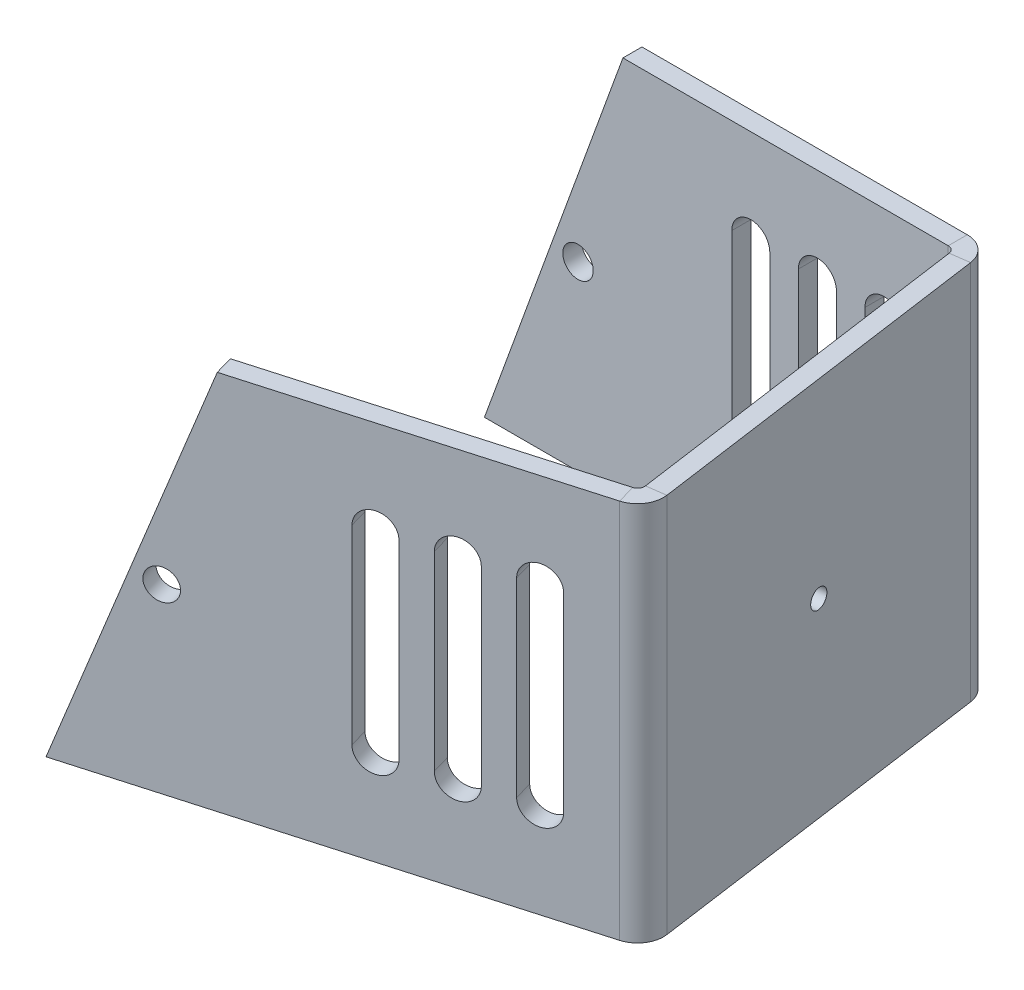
ISO-10303-21;
HEADER;
FILE_DESCRIPTION(('STEP AP214'),'2;1');
FILE_NAME('part.step','',(''),(''),'','','');
FILE_SCHEMA(('AUTOMOTIVE_DESIGN { 1 0 10303 214 1 1 1 1 }'));
ENDSEC;
DATA;
#1=APPLICATION_CONTEXT('core data for automotive mechanical design processes');
#2=APPLICATION_PROTOCOL_DEFINITION('international standard','automotive_design',2000,#1);
#3=PRODUCT_CONTEXT('',#1,'mechanical');
#4=PRODUCT('Part','Part','',(#3));
#5=PRODUCT_RELATED_PRODUCT_CATEGORY('part','',(#4));
#6=PRODUCT_DEFINITION_FORMATION('','',#4);
#7=PRODUCT_DEFINITION_CONTEXT('part definition',#1,'design');
#8=PRODUCT_DEFINITION('design','',#6,#7);
#9=PRODUCT_DEFINITION_SHAPE('','',#8);
#10=(LENGTH_UNIT() NAMED_UNIT(*) SI_UNIT(.MILLI.,.METRE.));
#11=(NAMED_UNIT(*) PLANE_ANGLE_UNIT() SI_UNIT($,.RADIAN.));
#12=(NAMED_UNIT(*) SI_UNIT($,.STERADIAN.) SOLID_ANGLE_UNIT());
#13=UNCERTAINTY_MEASURE_WITH_UNIT(LENGTH_MEASURE(1.E-05),#10,'distance_accuracy_value','');
#14=(GEOMETRIC_REPRESENTATION_CONTEXT(3) GLOBAL_UNCERTAINTY_ASSIGNED_CONTEXT((#13)) GLOBAL_UNIT_ASSIGNED_CONTEXT((#10,
#11,#12)) REPRESENTATION_CONTEXT('',''));
#15=CARTESIAN_POINT('',(0.,0.,0.));
#16=DIRECTION('',(0.,0.,1.));
#17=DIRECTION('',(1.,0.,0.));
#18=AXIS2_PLACEMENT_3D('',#15,#16,#17);
#19=CARTESIAN_POINT('',(46.3618846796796,40.000211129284,-33.9710555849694));
#20=DIRECTION('',(0.990268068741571,0.,-0.139173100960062));
#21=DIRECTION('',(-0.139173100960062,0.,-0.990268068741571));
#22=AXIS2_PLACEMENT_3D('',#19,#20,#21);
#23=PLANE('',#22);
#24=CARTESIAN_POINT('',(54.0777964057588,20.,20.9305090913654));
#25=DIRECTION('',(-0.990268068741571,0.,0.139173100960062));
#26=DIRECTION('',(0.139173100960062,0.,0.990268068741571));
#27=AXIS2_PLACEMENT_3D('',#24,#25,#26);
#28=CIRCLE('',#27,0.999999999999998);
#29=CARTESIAN_POINT('',(54.2169695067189,20.,21.920777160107));
#30=VERTEX_POINT('',#29);
#31=EDGE_CURVE('E337',#30,#30,#28,.T.);
#32=ORIENTED_EDGE('',*,*,#31,.T.);
#33=EDGE_LOOP('',(#32));
#34=FACE_BOUND('',#33,.T.);
#35=DIRECTION('',(-0.139173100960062,0.,-0.990268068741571));
#36=VECTOR('',#35,1.);
#37=CARTESIAN_POINT('',(46.3618846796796,40.000211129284,-33.9710555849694));
#38=LINE('',#37,#36);
#39=CARTESIAN_POINT('',(56.688310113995,40.000211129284,39.5052792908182));
#40=VERTEX_POINT('',#39);
#41=CARTESIAN_POINT('',(51.4672827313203,40.000211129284,2.35573888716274));
#42=VERTEX_POINT('',#41);
#43=EDGE_CURVE('E58',#40,#42,#38,.T.);
#44=ORIENTED_EDGE('',*,*,#43,.F.);
#45=DIRECTION('',(0.,-1.,0.));
#46=VECTOR('',#45,1.);
#47=CARTESIAN_POINT('',(56.688310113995,40.000211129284,39.5052792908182));
#48=LINE('',#47,#46);
#49=CARTESIAN_POINT('',(56.688310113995,0.,39.5052792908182));
#50=VERTEX_POINT('',#49);
#51=EDGE_CURVE('E50',#40,#50,#48,.T.);
#52=ORIENTED_EDGE('',*,*,#51,.T.);
#53=DIRECTION('',(0.139173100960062,0.,0.990268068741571));
#54=VECTOR('',#53,1.);
#55=CARTESIAN_POINT('',(44.3356793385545,0.,-48.3882557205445));
#56=LINE('',#55,#54);
#57=CARTESIAN_POINT('',(51.4672826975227,0.,2.35573889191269));
#58=VERTEX_POINT('',#57);
#59=EDGE_CURVE('E66',#58,#50,#56,.T.);
#60=ORIENTED_EDGE('',*,*,#59,.F.);
#61=DIRECTION('',(0.,-1.,0.));
#62=VECTOR('',#61,1.);
#63=CARTESIAN_POINT('',(51.4672826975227,40.000211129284,2.35573889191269));
#64=LINE('',#63,#62);
#65=EDGE_CURVE('E471',#42,#58,#64,.T.);
#66=ORIENTED_EDGE('',*,*,#65,.F.);
#67=EDGE_LOOP('',(#44,#52,#60,#66));
#68=FACE_BOUND('',#67,.T.);
#69=ADVANCED_FACE('F41',(#34,#68),#23,.T.);
#70=CARTESIAN_POINT('',(44.3813485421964,40.000211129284,-33.6927093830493));
#71=DIRECTION('',(0.,-1.,0.));
#72=DIRECTION('',(0.990268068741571,0.,-0.139173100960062));
#73=AXIS2_PLACEMENT_3D('',#70,#71,#72);
#74=PLANE('',#73);
#75=DIRECTION('',(-0.990268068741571,0.,0.139173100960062));
#76=VECTOR('',#75,1.);
#77=CARTESIAN_POINT('',(54.7077739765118,40.000211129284,39.7836254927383));
#78=LINE('',#77,#76);
#79=CARTESIAN_POINT('',(54.7077739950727,40.000211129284,39.7836254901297));
#80=VERTEX_POINT('',#79);
#81=EDGE_CURVE('E12',#40,#80,#78,.T.);
#82=ORIENTED_EDGE('',*,*,#81,.F.);
#83=ORIENTED_EDGE('',*,*,#43,.T.);
#84=DIRECTION('',(-0.990268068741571,0.,0.139173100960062));
#85=VECTOR('',#84,1.);
#86=CARTESIAN_POINT('',(49.4867465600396,40.000211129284,2.63408509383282));
#87=LINE('',#86,#85);
#88=CARTESIAN_POINT('',(49.4867466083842,40.000211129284,2.63408508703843));
#89=VERTEX_POINT('',#88);
#90=EDGE_CURVE('E468',#42,#89,#87,.T.);
#91=ORIENTED_EDGE('',*,*,#90,.T.);
#92=DIRECTION('',(-0.139173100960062,0.,-0.990268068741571));
#93=VECTOR('',#92,1.);
#94=CARTESIAN_POINT('',(44.3813485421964,40.000211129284,-33.6927093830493));
#95=LINE('',#94,#93);
#96=EDGE_CURVE('E45',#80,#89,#95,.T.);
#97=ORIENTED_EDGE('',*,*,#96,.F.);
#98=EDGE_LOOP('',(#82,#83,#91,#97));
#99=FACE_BOUND('',#98,.T.);
#100=ADVANCED_FACE('F43',(#99),#74,.F.);
#101=CARTESIAN_POINT('',(42.3551432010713,0.,-48.1099095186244));
#102=DIRECTION('',(0.,1.,0.));
#103=DIRECTION('',(-0.990268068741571,0.,0.139173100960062));
#104=AXIS2_PLACEMENT_3D('',#101,#102,#103);
#105=PLANE('',#104);
#106=DIRECTION('',(0.990268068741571,0.,-0.139173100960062));
#107=VECTOR('',#106,1.);
#108=CARTESIAN_POINT('',(54.7077739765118,0.,39.7836254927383));
#109=LINE('',#108,#107);
#110=CARTESIAN_POINT('',(54.7077739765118,0.,39.7836254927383));
#111=VERTEX_POINT('',#110);
#112=EDGE_CURVE('E478',#111,#50,#109,.T.);
#113=ORIENTED_EDGE('',*,*,#112,.F.);
#114=DIRECTION('',(0.139173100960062,0.,0.990268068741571));
#115=VECTOR('',#114,1.);
#116=CARTESIAN_POINT('',(42.3551432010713,0.,-48.1099095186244));
#117=LINE('',#116,#115);
#118=CARTESIAN_POINT('',(49.4867466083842,0.,2.63408508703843));
#119=VERTEX_POINT('',#118);
#120=EDGE_CURVE('E483',#119,#111,#117,.T.);
#121=ORIENTED_EDGE('',*,*,#120,.F.);
#122=DIRECTION('',(0.990268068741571,0.,-0.139173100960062));
#123=VECTOR('',#122,1.);
#124=CARTESIAN_POINT('',(49.4867465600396,0.,2.63408509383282));
#125=LINE('',#124,#123);
#126=EDGE_CURVE('E473',#119,#58,#125,.T.);
#127=ORIENTED_EDGE('',*,*,#126,.T.);
#128=ORIENTED_EDGE('',*,*,#59,.T.);
#129=EDGE_LOOP('',(#113,#121,#127,#128));
#130=FACE_BOUND('',#129,.T.);
#131=ADVANCED_FACE('F538',(#130),#105,.F.);
#132=CARTESIAN_POINT('',(44.3813485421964,40.000211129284,-33.6927093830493));
#133=DIRECTION('',(0.990268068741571,0.,-0.139173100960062));
#134=DIRECTION('',(-0.139173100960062,0.,-0.990268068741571));
#135=AXIS2_PLACEMENT_3D('',#132,#133,#134);
#136=PLANE('',#135);
#137=DIRECTION('',(0.,-1.,0.));
#138=VECTOR('',#137,1.);
#139=CARTESIAN_POINT('',(54.7077739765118,40.000211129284,39.7836254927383));
#140=LINE('',#139,#138);
#141=EDGE_CURVE('E475',#80,#111,#140,.T.);
#142=ORIENTED_EDGE('',*,*,#141,.F.);
#143=ORIENTED_EDGE('',*,*,#96,.T.);
#144=DIRECTION('',(0.,-1.,0.));
#145=VECTOR('',#144,1.);
#146=CARTESIAN_POINT('',(49.4867465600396,40.000211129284,2.63408509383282));
#147=LINE('',#146,#145);
#148=EDGE_CURVE('E465',#89,#119,#147,.T.);
#149=ORIENTED_EDGE('',*,*,#148,.T.);
#150=ORIENTED_EDGE('',*,*,#120,.T.);
#151=EDGE_LOOP('',(#142,#143,#149,#150));
#152=FACE_BOUND('',#151,.T.);
#153=CARTESIAN_POINT('',(52.0972602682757,20.,21.2088552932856));
#154=DIRECTION('',(-0.990268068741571,0.,0.139173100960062));
#155=DIRECTION('',(0.139173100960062,0.,0.990268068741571));
#156=AXIS2_PLACEMENT_3D('',#153,#154,#155);
#157=CIRCLE('',#156,0.999999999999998);
#158=CARTESIAN_POINT('',(52.2364333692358,20.,22.1991233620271));
#159=VERTEX_POINT('',#158);
#160=EDGE_CURVE('E462',#159,#159,#157,.T.);
#161=ORIENTED_EDGE('',*,*,#160,.F.);
#162=EDGE_LOOP('',(#161));
#163=FACE_BOUND('',#162,.T.);
#164=ADVANCED_FACE('F488',(#152,#163),#136,.F.);
#165=CARTESIAN_POINT('',(52.0972602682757,20.,21.2088552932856));
#166=DIRECTION('',(0.990268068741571,0.,-0.139173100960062));
#167=DIRECTION('',(-0.139173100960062,0.,-0.990268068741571));
#168=AXIS2_PLACEMENT_3D('',#165,#166,#167);
#169=CYLINDRICAL_SURFACE('',#168,0.999999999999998);
#170=ORIENTED_EDGE('',*,*,#160,.T.);
#171=EDGE_LOOP('',(#170));
#172=FACE_BOUND('',#171,.T.);
#173=ORIENTED_EDGE('',*,*,#31,.F.);
#174=EDGE_LOOP('',(#173));
#175=FACE_BOUND('',#174,.T.);
#176=ADVANCED_FACE('F544',(#172,#175),#169,.F.);
#177=CARTESIAN_POINT('',(9.83646703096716,19.0694249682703,2.));
#178=DIRECTION('',(0.,0.,-1.));
#179=DIRECTION('',(-1.,0.,0.));
#180=AXIS2_PLACEMENT_3D('',#177,#178,#179);
#181=CYLINDRICAL_SURFACE('',#180,1.6);
#182=CARTESIAN_POINT('',(9.83646703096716,19.0694249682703,2.));
#183=DIRECTION('',(0.,0.,1.));
#184=DIRECTION('',(1.,0.,0.));
#185=AXIS2_PLACEMENT_3D('',#182,#183,#184);
#186=CIRCLE('',#185,1.6);
#187=CARTESIAN_POINT('',(11.4364670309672,19.0694249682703,2.));
#188=VERTEX_POINT('',#187);
#189=EDGE_CURVE('E449',#188,#188,#186,.T.);
#190=ORIENTED_EDGE('',*,*,#189,.T.);
#191=EDGE_LOOP('',(#190));
#192=FACE_BOUND('',#191,.T.);
#193=CARTESIAN_POINT('',(9.83646703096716,19.0694249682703,0.));
#194=DIRECTION('',(0.,0.,1.));
#195=DIRECTION('',(1.,0.,0.));
#196=AXIS2_PLACEMENT_3D('',#193,#194,#195);
#197=CIRCLE('',#196,1.6);
#198=CARTESIAN_POINT('',(11.4364670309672,19.0694249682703,0.));
#199=VERTEX_POINT('',#198);
#200=EDGE_CURVE('E344',#199,#199,#197,.T.);
#201=ORIENTED_EDGE('',*,*,#200,.F.);
#202=EDGE_LOOP('',(#201));
#203=FACE_BOUND('',#202,.T.);
#204=ADVANCED_FACE('F547',(#192,#203),#181,.F.);
#205=CARTESIAN_POINT('',(42.,10.,-8.));
#206=DIRECTION('',(0.,0.,1.));
#207=DIRECTION('',(1.,0.,0.));
#208=AXIS2_PLACEMENT_3D('',#205,#206,#207);
#209=CYLINDRICAL_SURFACE('',#208,2.);
#210=CARTESIAN_POINT('',(42.,10.,0.));
#211=DIRECTION('',(0.,0.,-1.));
#212=DIRECTION('',(-1.,0.,0.));
#213=AXIS2_PLACEMENT_3D('',#210,#211,#212);
#214=CIRCLE('',#213,2.);
#215=CARTESIAN_POINT('',(44.,10.,0.));
#216=VERTEX_POINT('',#215);
#217=CARTESIAN_POINT('',(40.,10.,0.));
#218=VERTEX_POINT('',#217);
#219=EDGE_CURVE('E446',#216,#218,#214,.T.);
#220=ORIENTED_EDGE('',*,*,#219,.T.);
#221=DIRECTION('',(0.,0.,1.));
#222=VECTOR('',#221,1.);
#223=CARTESIAN_POINT('',(40.,10.,-8.));
#224=LINE('',#223,#222);
#225=CARTESIAN_POINT('',(40.,10.,2.));
#226=VERTEX_POINT('',#225);
#227=EDGE_CURVE('E444',#218,#226,#224,.T.);
#228=ORIENTED_EDGE('',*,*,#227,.T.);
#229=CARTESIAN_POINT('',(42.,10.,2.));
#230=DIRECTION('',(0.,0.,1.));
#231=DIRECTION('',(-1.,0.,0.));
#232=AXIS2_PLACEMENT_3D('',#229,#230,#231);
#233=CIRCLE('',#232,2.);
#234=CARTESIAN_POINT('',(44.,10.,2.));
#235=VERTEX_POINT('',#234);
#236=EDGE_CURVE('E441',#226,#235,#233,.T.);
#237=ORIENTED_EDGE('',*,*,#236,.T.);
#238=DIRECTION('',(0.,0.,1.));
#239=VECTOR('',#238,1.);
#240=CARTESIAN_POINT('',(44.,10.,-8.));
#241=LINE('',#240,#239);
#242=EDGE_CURVE('E437',#216,#235,#241,.T.);
#243=ORIENTED_EDGE('',*,*,#242,.F.);
#244=EDGE_LOOP('',(#220,#228,#237,#243));
#245=FACE_BOUND('',#244,.T.);
#246=ADVANCED_FACE('F801',(#245),#209,.F.);
#247=CARTESIAN_POINT('',(44.,30.000211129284,-8.));
#248=DIRECTION('',(1.,0.,0.));
#249=DIRECTION('',(0.,0.,-1.));
#250=AXIS2_PLACEMENT_3D('',#247,#248,#249);
#251=PLANE('',#250);
#252=DIRECTION('',(0.,-1.,0.));
#253=VECTOR('',#252,1.);
#254=CARTESIAN_POINT('',(44.,40.000211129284,0.));
#255=LINE('',#254,#253);
#256=CARTESIAN_POINT('',(44.,30.000211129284,0.));
#257=VERTEX_POINT('',#256);
#258=EDGE_CURVE('E439',#257,#216,#255,.T.);
#259=ORIENTED_EDGE('',*,*,#258,.T.);
#260=ORIENTED_EDGE('',*,*,#242,.T.);
#261=DIRECTION('',(0.,1.,0.));
#262=VECTOR('',#261,1.);
#263=CARTESIAN_POINT('',(44.,30.000211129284,2.));
#264=LINE('',#263,#262);
#265=CARTESIAN_POINT('',(44.,30.000211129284,2.));
#266=VERTEX_POINT('',#265);
#267=EDGE_CURVE('E434',#235,#266,#264,.T.);
#268=ORIENTED_EDGE('',*,*,#267,.T.);
#269=DIRECTION('',(0.,0.,1.));
#270=VECTOR('',#269,1.);
#271=CARTESIAN_POINT('',(44.,30.000211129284,-8.));
#272=LINE('',#271,#270);
#273=EDGE_CURVE('E430',#257,#266,#272,.T.);
#274=ORIENTED_EDGE('',*,*,#273,.F.);
#275=EDGE_LOOP('',(#259,#260,#268,#274));
#276=FACE_BOUND('',#275,.T.);
#277=ADVANCED_FACE('F809',(#276),#251,.F.);
#278=CARTESIAN_POINT('',(42.,30.000211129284,-8.));
#279=DIRECTION('',(0.,0.,1.));
#280=DIRECTION('',(1.,0.,0.));
#281=AXIS2_PLACEMENT_3D('',#278,#279,#280);
#282=CYLINDRICAL_SURFACE('',#281,2.);
#283=CARTESIAN_POINT('',(42.,30.000211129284,0.));
#284=DIRECTION('',(0.,0.,-1.));
#285=DIRECTION('',(-1.,0.,0.));
#286=AXIS2_PLACEMENT_3D('',#283,#284,#285);
#287=CIRCLE('',#286,2.);
#288=CARTESIAN_POINT('',(40.,30.000211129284,0.));
#289=VERTEX_POINT('',#288);
#290=EDGE_CURVE('E432',#289,#257,#287,.T.);
#291=ORIENTED_EDGE('',*,*,#290,.T.);
#292=ORIENTED_EDGE('',*,*,#273,.T.);
#293=CARTESIAN_POINT('',(42.,30.000211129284,2.));
#294=DIRECTION('',(0.,0.,1.));
#295=DIRECTION('',(-1.,0.,0.));
#296=AXIS2_PLACEMENT_3D('',#293,#294,#295);
#297=CIRCLE('',#296,2.);
#298=CARTESIAN_POINT('',(40.,30.000211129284,2.));
#299=VERTEX_POINT('',#298);
#300=EDGE_CURVE('E428',#266,#299,#297,.T.);
#301=ORIENTED_EDGE('',*,*,#300,.T.);
#302=DIRECTION('',(0.,0.,1.));
#303=VECTOR('',#302,1.);
#304=CARTESIAN_POINT('',(40.,30.000211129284,-8.));
#305=LINE('',#304,#303);
#306=EDGE_CURVE('E423',#289,#299,#305,.T.);
#307=ORIENTED_EDGE('',*,*,#306,.F.);
#308=EDGE_LOOP('',(#291,#292,#301,#307));
#309=FACE_BOUND('',#308,.T.);
#310=ADVANCED_FACE('F817',(#309),#282,.F.);
#311=CARTESIAN_POINT('',(40.,30.000211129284,-8.));
#312=DIRECTION('',(-1.,0.,0.));
#313=DIRECTION('',(0.,0.,1.));
#314=AXIS2_PLACEMENT_3D('',#311,#312,#313);
#315=PLANE('',#314);
#316=DIRECTION('',(0.,1.,0.));
#317=VECTOR('',#316,1.);
#318=CARTESIAN_POINT('',(40.,40.000211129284,0.));
#319=LINE('',#318,#317);
#320=EDGE_CURVE('E426',#218,#289,#319,.T.);
#321=ORIENTED_EDGE('',*,*,#320,.T.);
#322=ORIENTED_EDGE('',*,*,#306,.T.);
#323=DIRECTION('',(0.,-1.,0.));
#324=VECTOR('',#323,1.);
#325=CARTESIAN_POINT('',(40.,30.000211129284,2.));
#326=LINE('',#325,#324);
#327=EDGE_CURVE('E420',#299,#226,#326,.T.);
#328=ORIENTED_EDGE('',*,*,#327,.T.);
#329=ORIENTED_EDGE('',*,*,#227,.F.);
#330=EDGE_LOOP('',(#321,#322,#328,#329));
#331=FACE_BOUND('',#330,.T.);
#332=ADVANCED_FACE('F825',(#331),#315,.F.);
#333=CARTESIAN_POINT('',(35.,10.,-8.));
#334=DIRECTION('',(0.,0.,1.));
#335=DIRECTION('',(1.,0.,0.));
#336=AXIS2_PLACEMENT_3D('',#333,#334,#335);
#337=CYLINDRICAL_SURFACE('',#336,2.);
#338=CARTESIAN_POINT('',(35.,10.,0.));
#339=DIRECTION('',(0.,0.,-1.));
#340=DIRECTION('',(-1.,0.,0.));
#341=AXIS2_PLACEMENT_3D('',#338,#339,#340);
#342=CIRCLE('',#341,2.);
#343=CARTESIAN_POINT('',(37.,10.,0.));
#344=VERTEX_POINT('',#343);
#345=CARTESIAN_POINT('',(33.,10.,0.));
#346=VERTEX_POINT('',#345);
#347=EDGE_CURVE('E417',#344,#346,#342,.T.);
#348=ORIENTED_EDGE('',*,*,#347,.T.);
#349=DIRECTION('',(0.,0.,1.));
#350=VECTOR('',#349,1.);
#351=CARTESIAN_POINT('',(33.,10.,-8.));
#352=LINE('',#351,#350);
#353=CARTESIAN_POINT('',(33.,10.,2.));
#354=VERTEX_POINT('',#353);
#355=EDGE_CURVE('E415',#346,#354,#352,.T.);
#356=ORIENTED_EDGE('',*,*,#355,.T.);
#357=CARTESIAN_POINT('',(35.,10.,2.));
#358=DIRECTION('',(0.,0.,1.));
#359=DIRECTION('',(-1.,0.,0.));
#360=AXIS2_PLACEMENT_3D('',#357,#358,#359);
#361=CIRCLE('',#360,2.);
#362=CARTESIAN_POINT('',(37.,10.,2.));
#363=VERTEX_POINT('',#362);
#364=EDGE_CURVE('E412',#354,#363,#361,.T.);
#365=ORIENTED_EDGE('',*,*,#364,.T.);
#366=DIRECTION('',(0.,0.,1.));
#367=VECTOR('',#366,1.);
#368=CARTESIAN_POINT('',(37.,10.,-8.));
#369=LINE('',#368,#367);
#370=EDGE_CURVE('E408',#344,#363,#369,.T.);
#371=ORIENTED_EDGE('',*,*,#370,.F.);
#372=EDGE_LOOP('',(#348,#356,#365,#371));
#373=FACE_BOUND('',#372,.T.);
#374=ADVANCED_FACE('F833',(#373),#337,.F.);
#375=CARTESIAN_POINT('',(37.,30.000211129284,-8.));
#376=DIRECTION('',(1.,0.,0.));
#377=DIRECTION('',(0.,0.,-1.));
#378=AXIS2_PLACEMENT_3D('',#375,#376,#377);
#379=PLANE('',#378);
#380=DIRECTION('',(0.,-1.,0.));
#381=VECTOR('',#380,1.);
#382=CARTESIAN_POINT('',(37.,40.000211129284,0.));
#383=LINE('',#382,#381);
#384=CARTESIAN_POINT('',(37.,30.000211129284,0.));
#385=VERTEX_POINT('',#384);
#386=EDGE_CURVE('E410',#385,#344,#383,.T.);
#387=ORIENTED_EDGE('',*,*,#386,.T.);
#388=ORIENTED_EDGE('',*,*,#370,.T.);
#389=DIRECTION('',(0.,1.,0.));
#390=VECTOR('',#389,1.);
#391=CARTESIAN_POINT('',(37.,30.000211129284,2.));
#392=LINE('',#391,#390);
#393=CARTESIAN_POINT('',(37.,30.000211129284,2.));
#394=VERTEX_POINT('',#393);
#395=EDGE_CURVE('E405',#363,#394,#392,.T.);
#396=ORIENTED_EDGE('',*,*,#395,.T.);
#397=DIRECTION('',(0.,0.,1.));
#398=VECTOR('',#397,1.);
#399=CARTESIAN_POINT('',(37.,30.000211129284,-8.));
#400=LINE('',#399,#398);
#401=EDGE_CURVE('E401',#385,#394,#400,.T.);
#402=ORIENTED_EDGE('',*,*,#401,.F.);
#403=EDGE_LOOP('',(#387,#388,#396,#402));
#404=FACE_BOUND('',#403,.T.);
#405=ADVANCED_FACE('F841',(#404),#379,.F.);
#406=CARTESIAN_POINT('',(35.,30.000211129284,-8.));
#407=DIRECTION('',(0.,0.,1.));
#408=DIRECTION('',(1.,0.,0.));
#409=AXIS2_PLACEMENT_3D('',#406,#407,#408);
#410=CYLINDRICAL_SURFACE('',#409,2.);
#411=CARTESIAN_POINT('',(35.,30.000211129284,0.));
#412=DIRECTION('',(0.,0.,-1.));
#413=DIRECTION('',(-1.,0.,0.));
#414=AXIS2_PLACEMENT_3D('',#411,#412,#413);
#415=CIRCLE('',#414,2.);
#416=CARTESIAN_POINT('',(33.,30.000211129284,0.));
#417=VERTEX_POINT('',#416);
#418=EDGE_CURVE('E403',#417,#385,#415,.T.);
#419=ORIENTED_EDGE('',*,*,#418,.T.);
#420=ORIENTED_EDGE('',*,*,#401,.T.);
#421=CARTESIAN_POINT('',(35.,30.000211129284,2.));
#422=DIRECTION('',(0.,0.,1.));
#423=DIRECTION('',(-1.,0.,0.));
#424=AXIS2_PLACEMENT_3D('',#421,#422,#423);
#425=CIRCLE('',#424,2.);
#426=CARTESIAN_POINT('',(33.,30.000211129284,2.));
#427=VERTEX_POINT('',#426);
#428=EDGE_CURVE('E399',#394,#427,#425,.T.);
#429=ORIENTED_EDGE('',*,*,#428,.T.);
#430=DIRECTION('',(0.,0.,1.));
#431=VECTOR('',#430,1.);
#432=CARTESIAN_POINT('',(33.,30.000211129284,-8.));
#433=LINE('',#432,#431);
#434=EDGE_CURVE('E394',#417,#427,#433,.T.);
#435=ORIENTED_EDGE('',*,*,#434,.F.);
#436=EDGE_LOOP('',(#419,#420,#429,#435));
#437=FACE_BOUND('',#436,.T.);
#438=ADVANCED_FACE('F849',(#437),#410,.F.);
#439=CARTESIAN_POINT('',(33.,30.000211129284,-8.));
#440=DIRECTION('',(-1.,0.,0.));
#441=DIRECTION('',(0.,0.,1.));
#442=AXIS2_PLACEMENT_3D('',#439,#440,#441);
#443=PLANE('',#442);
#444=DIRECTION('',(0.,1.,0.));
#445=VECTOR('',#444,1.);
#446=CARTESIAN_POINT('',(33.,40.000211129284,0.));
#447=LINE('',#446,#445);
#448=EDGE_CURVE('E397',#346,#417,#447,.T.);
#449=ORIENTED_EDGE('',*,*,#448,.T.);
#450=ORIENTED_EDGE('',*,*,#434,.T.);
#451=DIRECTION('',(0.,-1.,0.));
#452=VECTOR('',#451,1.);
#453=CARTESIAN_POINT('',(33.,30.000211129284,2.));
#454=LINE('',#453,#452);
#455=EDGE_CURVE('E391',#427,#354,#454,.T.);
#456=ORIENTED_EDGE('',*,*,#455,.T.);
#457=ORIENTED_EDGE('',*,*,#355,.F.);
#458=EDGE_LOOP('',(#449,#450,#456,#457));
#459=FACE_BOUND('',#458,.T.);
#460=ADVANCED_FACE('F857',(#459),#443,.F.);
#461=CARTESIAN_POINT('',(28.,10.,-8.));
#462=DIRECTION('',(0.,0.,1.));
#463=DIRECTION('',(1.,0.,0.));
#464=AXIS2_PLACEMENT_3D('',#461,#462,#463);
#465=CYLINDRICAL_SURFACE('',#464,2.);
#466=CARTESIAN_POINT('',(28.,10.,0.));
#467=DIRECTION('',(0.,0.,-1.));
#468=DIRECTION('',(-1.,0.,0.));
#469=AXIS2_PLACEMENT_3D('',#466,#467,#468);
#470=CIRCLE('',#469,2.);
#471=CARTESIAN_POINT('',(30.,10.,0.));
#472=VERTEX_POINT('',#471);
#473=CARTESIAN_POINT('',(26.,10.,0.));
#474=VERTEX_POINT('',#473);
#475=EDGE_CURVE('E388',#472,#474,#470,.T.);
#476=ORIENTED_EDGE('',*,*,#475,.T.);
#477=DIRECTION('',(0.,0.,1.));
#478=VECTOR('',#477,1.);
#479=CARTESIAN_POINT('',(26.,10.,-8.));
#480=LINE('',#479,#478);
#481=CARTESIAN_POINT('',(26.,10.,2.));
#482=VERTEX_POINT('',#481);
#483=EDGE_CURVE('E386',#474,#482,#480,.T.);
#484=ORIENTED_EDGE('',*,*,#483,.T.);
#485=CARTESIAN_POINT('',(28.,10.,2.));
#486=DIRECTION('',(0.,0.,1.));
#487=DIRECTION('',(-1.,0.,0.));
#488=AXIS2_PLACEMENT_3D('',#485,#486,#487);
#489=CIRCLE('',#488,2.);
#490=CARTESIAN_POINT('',(30.,10.,2.));
#491=VERTEX_POINT('',#490);
#492=EDGE_CURVE('E383',#482,#491,#489,.T.);
#493=ORIENTED_EDGE('',*,*,#492,.T.);
#494=DIRECTION('',(0.,0.,1.));
#495=VECTOR('',#494,1.);
#496=CARTESIAN_POINT('',(30.,10.,-8.));
#497=LINE('',#496,#495);
#498=EDGE_CURVE('E379',#472,#491,#497,.T.);
#499=ORIENTED_EDGE('',*,*,#498,.F.);
#500=EDGE_LOOP('',(#476,#484,#493,#499));
#501=FACE_BOUND('',#500,.T.);
#502=ADVANCED_FACE('F865',(#501),#465,.F.);
#503=CARTESIAN_POINT('',(30.,30.000211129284,-8.));
#504=DIRECTION('',(1.,0.,0.));
#505=DIRECTION('',(0.,0.,-1.));
#506=AXIS2_PLACEMENT_3D('',#503,#504,#505);
#507=PLANE('',#506);
#508=DIRECTION('',(0.,-1.,0.));
#509=VECTOR('',#508,1.);
#510=CARTESIAN_POINT('',(30.,40.000211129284,0.));
#511=LINE('',#510,#509);
#512=CARTESIAN_POINT('',(30.,30.000211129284,0.));
#513=VERTEX_POINT('',#512);
#514=EDGE_CURVE('E381',#513,#472,#511,.T.);
#515=ORIENTED_EDGE('',*,*,#514,.T.);
#516=ORIENTED_EDGE('',*,*,#498,.T.);
#517=DIRECTION('',(0.,1.,0.));
#518=VECTOR('',#517,1.);
#519=CARTESIAN_POINT('',(30.,30.000211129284,2.));
#520=LINE('',#519,#518);
#521=CARTESIAN_POINT('',(30.,30.000211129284,2.));
#522=VERTEX_POINT('',#521);
#523=EDGE_CURVE('E376',#491,#522,#520,.T.);
#524=ORIENTED_EDGE('',*,*,#523,.T.);
#525=DIRECTION('',(0.,0.,1.));
#526=VECTOR('',#525,1.);
#527=CARTESIAN_POINT('',(30.,30.000211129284,-8.));
#528=LINE('',#527,#526);
#529=EDGE_CURVE('E372',#513,#522,#528,.T.);
#530=ORIENTED_EDGE('',*,*,#529,.F.);
#531=EDGE_LOOP('',(#515,#516,#524,#530));
#532=FACE_BOUND('',#531,.T.);
#533=ADVANCED_FACE('F873',(#532),#507,.F.);
#534=CARTESIAN_POINT('',(28.,30.000211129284,-8.));
#535=DIRECTION('',(0.,0.,1.));
#536=DIRECTION('',(1.,0.,0.));
#537=AXIS2_PLACEMENT_3D('',#534,#535,#536);
#538=CYLINDRICAL_SURFACE('',#537,2.);
#539=CARTESIAN_POINT('',(28.,30.000211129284,0.));
#540=DIRECTION('',(0.,0.,-1.));
#541=DIRECTION('',(-1.,0.,0.));
#542=AXIS2_PLACEMENT_3D('',#539,#540,#541);
#543=CIRCLE('',#542,2.);
#544=CARTESIAN_POINT('',(26.,30.000211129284,0.));
#545=VERTEX_POINT('',#544);
#546=EDGE_CURVE('E374',#545,#513,#543,.T.);
#547=ORIENTED_EDGE('',*,*,#546,.T.);
#548=ORIENTED_EDGE('',*,*,#529,.T.);
#549=CARTESIAN_POINT('',(28.,30.000211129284,2.));
#550=DIRECTION('',(0.,0.,1.));
#551=DIRECTION('',(-1.,0.,0.));
#552=AXIS2_PLACEMENT_3D('',#549,#550,#551);
#553=CIRCLE('',#552,2.);
#554=CARTESIAN_POINT('',(26.,30.000211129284,2.));
#555=VERTEX_POINT('',#554);
#556=EDGE_CURVE('E370',#522,#555,#553,.T.);
#557=ORIENTED_EDGE('',*,*,#556,.T.);
#558=DIRECTION('',(0.,0.,1.));
#559=VECTOR('',#558,1.);
#560=CARTESIAN_POINT('',(26.,30.000211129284,-8.));
#561=LINE('',#560,#559);
#562=EDGE_CURVE('E365',#545,#555,#561,.T.);
#563=ORIENTED_EDGE('',*,*,#562,.F.);
#564=EDGE_LOOP('',(#547,#548,#557,#563));
#565=FACE_BOUND('',#564,.T.);
#566=ADVANCED_FACE('F530',(#565),#538,.F.);
#567=CARTESIAN_POINT('',(26.,30.000211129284,-8.));
#568=DIRECTION('',(-1.,0.,0.));
#569=DIRECTION('',(0.,0.,1.));
#570=AXIS2_PLACEMENT_3D('',#567,#568,#569);
#571=PLANE('',#570);
#572=DIRECTION('',(0.,1.,0.));
#573=VECTOR('',#572,1.);
#574=CARTESIAN_POINT('',(26.,40.000211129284,0.));
#575=LINE('',#574,#573);
#576=EDGE_CURVE('E368',#474,#545,#575,.T.);
#577=ORIENTED_EDGE('',*,*,#576,.T.);
#578=ORIENTED_EDGE('',*,*,#562,.T.);
#579=DIRECTION('',(0.,-1.,0.));
#580=VECTOR('',#579,1.);
#581=CARTESIAN_POINT('',(26.,30.000211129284,2.));
#582=LINE('',#581,#580);
#583=EDGE_CURVE('E362',#555,#482,#582,.T.);
#584=ORIENTED_EDGE('',*,*,#583,.T.);
#585=ORIENTED_EDGE('',*,*,#483,.F.);
#586=EDGE_LOOP('',(#577,#578,#584,#585));
#587=FACE_BOUND('',#586,.T.);
#588=ADVANCED_FACE('F523',(#587),#571,.F.);
#589=CARTESIAN_POINT('',(0.,0.,2.));
#590=DIRECTION('',(0.93969262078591,-0.342020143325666,0.));
#591=DIRECTION('',(0.342020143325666,0.93969262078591,0.));
#592=AXIS2_PLACEMENT_3D('',#589,#590,#591);
#593=PLANE('',#592);
#594=DIRECTION('',(-0.342020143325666,-0.939692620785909,0.));
#595=VECTOR('',#594,1.);
#596=CARTESIAN_POINT('',(0.,0.,0.));
#597=LINE('',#596,#595);
#598=CARTESIAN_POINT('',(14.5588862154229,40.000211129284,0.));
#599=VERTEX_POINT('',#598);
#600=CARTESIAN_POINT('',(0.,0.,0.));
#601=VERTEX_POINT('',#600);
#602=EDGE_CURVE('E359',#599,#601,#597,.T.);
#603=ORIENTED_EDGE('',*,*,#602,.T.);
#604=DIRECTION('',(0.,0.,-1.));
#605=VECTOR('',#604,1.);
#606=CARTESIAN_POINT('',(0.,0.,2.));
#607=LINE('',#606,#605);
#608=CARTESIAN_POINT('',(0.,0.,2.));
#609=VERTEX_POINT('',#608);
#610=EDGE_CURVE('E338',#609,#601,#607,.T.);
#611=ORIENTED_EDGE('',*,*,#610,.F.);
#612=DIRECTION('',(-0.342020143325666,-0.939692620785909,0.));
#613=VECTOR('',#612,1.);
#614=CARTESIAN_POINT('',(0.,0.,2.));
#615=LINE('',#614,#613);
#616=CARTESIAN_POINT('',(14.5588862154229,40.000211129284,2.));
#617=VERTEX_POINT('',#616);
#618=EDGE_CURVE('E351',#617,#609,#615,.T.);
#619=ORIENTED_EDGE('',*,*,#618,.F.);
#620=DIRECTION('',(0.,0.,-1.));
#621=VECTOR('',#620,1.);
#622=CARTESIAN_POINT('',(14.5588862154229,40.000211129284,2.));
#623=LINE('',#622,#621);
#624=EDGE_CURVE('E356',#617,#599,#623,.T.);
#625=ORIENTED_EDGE('',*,*,#624,.T.);
#626=EDGE_LOOP('',(#603,#611,#619,#625));
#627=FACE_BOUND('',#626,.T.);
#628=ADVANCED_FACE('F521',(#627),#593,.F.);
#629=CARTESIAN_POINT('',(14.5588862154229,40.000211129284,2.));
#630=DIRECTION('',(0.,0.,-1.));
#631=DIRECTION('',(-1.,0.,0.));
#632=AXIS2_PLACEMENT_3D('',#629,#630,#631);
#633=PLANE('',#632);
#634=DIRECTION('',(0.,-1.,0.));
#635=VECTOR('',#634,1.);
#636=CARTESIAN_POINT('',(48.7573151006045,40.000211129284,2.));
#637=LINE('',#636,#635);
#638=CARTESIAN_POINT('',(48.7573151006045,40.000211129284,1.99999998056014));
#639=VERTEX_POINT('',#638);
#640=CARTESIAN_POINT('',(48.7573151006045,0.,2.));
#641=VERTEX_POINT('',#640);
#642=EDGE_CURVE('E334',#639,#641,#637,.T.);
#643=ORIENTED_EDGE('',*,*,#642,.F.);
#644=DIRECTION('',(-1.,0.,0.));
#645=VECTOR('',#644,1.);
#646=CARTESIAN_POINT('',(14.5588862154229,40.000211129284,2.));
#647=LINE('',#646,#645);
#648=EDGE_CURVE('E354',#639,#617,#647,.T.);
#649=ORIENTED_EDGE('',*,*,#648,.T.);
#650=ORIENTED_EDGE('',*,*,#618,.T.);
#651=DIRECTION('',(1.,0.,0.));
#652=VECTOR('',#651,1.);
#653=CARTESIAN_POINT('',(0.,0.,2.));
#654=LINE('',#653,#652);
#655=EDGE_CURVE('E349',#609,#641,#654,.T.);
#656=ORIENTED_EDGE('',*,*,#655,.T.);
#657=EDGE_LOOP('',(#643,#649,#650,#656));
#658=FACE_BOUND('',#657,.T.);
#659=ORIENTED_EDGE('',*,*,#583,.F.);
#660=ORIENTED_EDGE('',*,*,#556,.F.);
#661=ORIENTED_EDGE('',*,*,#523,.F.);
#662=ORIENTED_EDGE('',*,*,#492,.F.);
#663=EDGE_LOOP('',(#659,#660,#661,#662));
#664=FACE_BOUND('',#663,.T.);
#665=ORIENTED_EDGE('',*,*,#455,.F.);
#666=ORIENTED_EDGE('',*,*,#428,.F.);
#667=ORIENTED_EDGE('',*,*,#395,.F.);
#668=ORIENTED_EDGE('',*,*,#364,.F.);
#669=EDGE_LOOP('',(#665,#666,#667,#668));
#670=FACE_BOUND('',#669,.T.);
#671=ORIENTED_EDGE('',*,*,#327,.F.);
#672=ORIENTED_EDGE('',*,*,#300,.F.);
#673=ORIENTED_EDGE('',*,*,#267,.F.);
#674=ORIENTED_EDGE('',*,*,#236,.F.);
#675=EDGE_LOOP('',(#671,#672,#673,#674));
#676=FACE_BOUND('',#675,.T.);
#677=ORIENTED_EDGE('',*,*,#189,.F.);
#678=EDGE_LOOP('',(#677));
#679=FACE_BOUND('',#678,.T.);
#680=ADVANCED_FACE('F513',(#658,#664,#670,#676,#679),#633,.F.);
#681=CARTESIAN_POINT('',(14.5588862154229,40.000211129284,2.));
#682=DIRECTION('',(0.,-1.,0.));
#683=DIRECTION('',(0.,0.,-1.));
#684=AXIS2_PLACEMENT_3D('',#681,#682,#683);
#685=PLANE('',#684);
#686=DIRECTION('',(0.,0.,1.));
#687=VECTOR('',#686,1.);
#688=CARTESIAN_POINT('',(48.7573151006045,40.000211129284,2.));
#689=LINE('',#688,#687);
#690=CARTESIAN_POINT('',(48.7573151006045,40.000211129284,0.));
#691=VERTEX_POINT('',#690);
#692=EDGE_CURVE('E452',#691,#639,#689,.T.);
#693=ORIENTED_EDGE('',*,*,#692,.F.);
#694=DIRECTION('',(-1.,0.,0.));
#695=VECTOR('',#694,1.);
#696=CARTESIAN_POINT('',(14.5588862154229,40.000211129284,0.));
#697=LINE('',#696,#695);
#698=EDGE_CURVE('E347',#691,#599,#697,.T.);
#699=ORIENTED_EDGE('',*,*,#698,.T.);
#700=ORIENTED_EDGE('',*,*,#624,.F.);
#701=ORIENTED_EDGE('',*,*,#648,.F.);
#702=EDGE_LOOP('',(#693,#699,#700,#701));
#703=FACE_BOUND('',#702,.T.);
#704=ADVANCED_FACE('F517',(#703),#685,.F.);
#705=CARTESIAN_POINT('',(14.5588862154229,40.000211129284,0.));
#706=DIRECTION('',(0.,0.,-1.));
#707=DIRECTION('',(-1.,0.,0.));
#708=AXIS2_PLACEMENT_3D('',#705,#706,#707);
#709=PLANE('',#708);
#710=ORIENTED_EDGE('',*,*,#546,.F.);
#711=ORIENTED_EDGE('',*,*,#576,.F.);
#712=ORIENTED_EDGE('',*,*,#475,.F.);
#713=ORIENTED_EDGE('',*,*,#514,.F.);
#714=EDGE_LOOP('',(#710,#711,#712,#713));
#715=FACE_BOUND('',#714,.T.);
#716=ORIENTED_EDGE('',*,*,#418,.F.);
#717=ORIENTED_EDGE('',*,*,#448,.F.);
#718=ORIENTED_EDGE('',*,*,#347,.F.);
#719=ORIENTED_EDGE('',*,*,#386,.F.);
#720=EDGE_LOOP('',(#716,#717,#718,#719));
#721=FACE_BOUND('',#720,.T.);
#722=ORIENTED_EDGE('',*,*,#290,.F.);
#723=ORIENTED_EDGE('',*,*,#320,.F.);
#724=ORIENTED_EDGE('',*,*,#219,.F.);
#725=ORIENTED_EDGE('',*,*,#258,.F.);
#726=EDGE_LOOP('',(#722,#723,#724,#725));
#727=FACE_BOUND('',#726,.T.);
#728=ORIENTED_EDGE('',*,*,#200,.T.);
#729=EDGE_LOOP('',(#728));
#730=FACE_BOUND('',#729,.T.);
#731=ORIENTED_EDGE('',*,*,#698,.F.);
#732=DIRECTION('',(0.,-1.,0.));
#733=VECTOR('',#732,1.);
#734=CARTESIAN_POINT('',(48.7573151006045,40.000211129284,0.));
#735=LINE('',#734,#733);
#736=CARTESIAN_POINT('',(48.7573151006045,0.,0.));
#737=VERTEX_POINT('',#736);
#738=EDGE_CURVE('E341',#691,#737,#735,.T.);
#739=ORIENTED_EDGE('',*,*,#738,.T.);
#740=DIRECTION('',(1.,0.,0.));
#741=VECTOR('',#740,1.);
#742=CARTESIAN_POINT('',(0.,0.,0.));
#743=LINE('',#742,#741);
#744=EDGE_CURVE('E335',#601,#737,#743,.T.);
#745=ORIENTED_EDGE('',*,*,#744,.F.);
#746=ORIENTED_EDGE('',*,*,#602,.F.);
#747=EDGE_LOOP('',(#731,#739,#745,#746));
#748=FACE_BOUND('',#747,.T.);
#749=ADVANCED_FACE('F500',(#715,#721,#727,#730,#748),#709,.T.);
#750=CARTESIAN_POINT('',(0.,0.,2.));
#751=DIRECTION('',(0.,1.,0.));
#752=DIRECTION('',(0.,0.,1.));
#753=AXIS2_PLACEMENT_3D('',#750,#751,#752);
#754=PLANE('',#753);
#755=DIRECTION('',(0.,0.,-1.));
#756=VECTOR('',#755,1.);
#757=CARTESIAN_POINT('',(48.7573151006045,0.,2.));
#758=LINE('',#757,#756);
#759=EDGE_CURVE('E455',#641,#737,#758,.T.);
#760=ORIENTED_EDGE('',*,*,#759,.F.);
#761=ORIENTED_EDGE('',*,*,#655,.F.);
#762=ORIENTED_EDGE('',*,*,#610,.T.);
#763=ORIENTED_EDGE('',*,*,#744,.T.);
#764=EDGE_LOOP('',(#760,#761,#762,#763));
#765=FACE_BOUND('',#764,.T.);
#766=ADVANCED_FACE('F508',(#765),#754,.F.);
#767=CARTESIAN_POINT('',(48.7573151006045,40.000211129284,2.73660003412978));
#768=DIRECTION('',(0.,-1.,0.));
#769=DIRECTION('',(0.,0.,-1.));
#770=AXIS2_PLACEMENT_3D('',#767,#768,#769);
#771=PLANE('',#770);
#772=ORIENTED_EDGE('',*,*,#90,.F.);
#773=CARTESIAN_POINT('',(48.7573151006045,40.000211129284,2.7366));
#774=DIRECTION('',(0.,1.,0.));
#775=DIRECTION('',(-1.,0.,0.));
#776=AXIS2_PLACEMENT_3D('',#773,#774,#775);
#777=CIRCLE('',#776,2.73660003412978);
#778=EDGE_CURVE('E322',#42,#691,#777,.T.);
#779=ORIENTED_EDGE('',*,*,#778,.T.);
#780=ORIENTED_EDGE('',*,*,#692,.T.);
#781=CARTESIAN_POINT('',(48.7573151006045,40.000211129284,2.73660003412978));
#782=DIRECTION('',(0.,1.,0.));
#783=DIRECTION('',(0.,0.,1.));
#784=AXIS2_PLACEMENT_3D('',#781,#782,#783);
#785=CIRCLE('',#784,0.736600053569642);
#786=EDGE_CURVE('E326',#89,#639,#785,.T.);
#787=ORIENTED_EDGE('',*,*,#786,.F.);
#788=EDGE_LOOP('',(#772,#779,#780,#787));
#789=FACE_BOUND('',#788,.T.);
#790=ADVANCED_FACE('F494',(#789),#771,.F.);
#791=CARTESIAN_POINT('',(48.7573151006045,0.,2.73660003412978));
#792=DIRECTION('',(0.,1.,0.));
#793=DIRECTION('',(-1.,0.,0.));
#794=AXIS2_PLACEMENT_3D('',#791,#792,#793);
#795=PLANE('',#794);
#796=ORIENTED_EDGE('',*,*,#759,.T.);
#797=CARTESIAN_POINT('',(48.7573151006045,0.,2.7366));
#798=DIRECTION('',(0.,1.,0.));
#799=DIRECTION('',(-1.,0.,0.));
#800=AXIS2_PLACEMENT_3D('',#797,#798,#799);
#801=CIRCLE('',#800,2.73660003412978);
#802=EDGE_CURVE('E323',#737,#58,#801,.F.);
#803=ORIENTED_EDGE('',*,*,#802,.T.);
#804=ORIENTED_EDGE('',*,*,#126,.F.);
#805=CARTESIAN_POINT('',(48.7573151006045,0.,2.73660003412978));
#806=DIRECTION('',(0.,-1.,0.));
#807=DIRECTION('',(1.,0.,0.));
#808=AXIS2_PLACEMENT_3D('',#805,#806,#807);
#809=CIRCLE('',#808,0.736600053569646);
#810=EDGE_CURVE('E331',#641,#119,#809,.T.);
#811=ORIENTED_EDGE('',*,*,#810,.F.);
#812=EDGE_LOOP('',(#796,#803,#804,#811));
#813=FACE_BOUND('',#812,.T.);
#814=ADVANCED_FACE('F506',(#813),#795,.F.);
#815=CARTESIAN_POINT('',(48.7573151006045,-20.1271165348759,2.7366));
#816=DIRECTION('',(0.,1.,0.));
#817=DIRECTION('',(-1.,0.,0.));
#818=AXIS2_PLACEMENT_3D('',#815,#816,#817);
#819=CYLINDRICAL_SURFACE('',#818,0.736600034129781);
#820=ORIENTED_EDGE('',*,*,#810,.T.);
#821=ORIENTED_EDGE('',*,*,#148,.F.);
#822=ORIENTED_EDGE('',*,*,#786,.T.);
#823=ORIENTED_EDGE('',*,*,#642,.T.);
#824=EDGE_LOOP('',(#820,#821,#822,#823));
#825=FACE_BOUND('',#824,.T.);
#826=ADVANCED_FACE('F511',(#825),#819,.F.);
#827=CARTESIAN_POINT('',(48.7573151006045,-20.1271165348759,2.7366));
#828=DIRECTION('',(0.,1.,0.));
#829=DIRECTION('',(-1.,0.,0.));
#830=AXIS2_PLACEMENT_3D('',#827,#828,#829);
#831=CYLINDRICAL_SURFACE('',#830,2.73660003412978);
#832=ORIENTED_EDGE('',*,*,#802,.F.);
#833=ORIENTED_EDGE('',*,*,#738,.F.);
#834=ORIENTED_EDGE('',*,*,#778,.F.);
#835=ORIENTED_EDGE('',*,*,#65,.T.);
#836=EDGE_LOOP('',(#832,#833,#834,#835));
#837=FACE_BOUND('',#836,.T.);
#838=ADVANCED_FACE('F498',(#837),#831,.T.);
#839=CARTESIAN_POINT('',(53.9783424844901,40.000211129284,39.8861404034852));
#840=DIRECTION('',(0.,-1.,0.));
#841=DIRECTION('',(0.,0.,-1.));
#842=AXIS2_PLACEMENT_3D('',#839,#840,#841);
#843=PLANE('',#842);
#844=DIRECTION('',(-0.275637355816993,0.,-0.961261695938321));
#845=VECTOR('',#844,1.);
#846=CARTESIAN_POINT('',(54.1813769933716,40.000211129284,40.5942057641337));
#847=LINE('',#846,#845);
#848=CARTESIAN_POINT('',(54.7326517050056,40.000211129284,42.5167291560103));
#849=VERTEX_POINT('',#848);
#850=CARTESIAN_POINT('',(54.1813769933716,40.000211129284,40.5942057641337));
#851=VERTEX_POINT('',#850);
#852=EDGE_CURVE('E1016',#849,#851,#847,.T.);
#853=ORIENTED_EDGE('',*,*,#852,.F.);
#854=CARTESIAN_POINT('',(53.9783425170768,40.000211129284,39.8861403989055));
#855=DIRECTION('',(0.,1.,0.));
#856=DIRECTION('',(0.,0.,1.));
#857=AXIS2_PLACEMENT_3D('',#854,#855,#856);
#858=CIRCLE('',#857,2.73660003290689);
#859=EDGE_CURVE('E313',#849,#40,#858,.T.);
#860=ORIENTED_EDGE('',*,*,#859,.T.);
#861=ORIENTED_EDGE('',*,*,#81,.T.);
#862=CARTESIAN_POINT('',(53.9783424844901,40.000211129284,39.8861404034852));
#863=DIRECTION('',(0.,1.,0.));
#864=DIRECTION('',(0.,0.,1.));
#865=AXIS2_PLACEMENT_3D('',#862,#863,#864);
#866=CIRCLE('',#865,0.736600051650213);
#867=EDGE_CURVE('E312',#851,#80,#866,.T.);
#868=ORIENTED_EDGE('',*,*,#867,.F.);
#869=EDGE_LOOP('',(#853,#860,#861,#868));
#870=FACE_BOUND('',#869,.T.);
#871=ADVANCED_FACE('F596',(#870),#843,.F.);
#872=CARTESIAN_POINT('',(53.9783424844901,0.,39.8861404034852));
#873=DIRECTION('',(0.,1.,0.));
#874=DIRECTION('',(-1.,0.,0.));
#875=AXIS2_PLACEMENT_3D('',#872,#873,#874);
#876=PLANE('',#875);
#877=ORIENTED_EDGE('',*,*,#112,.T.);
#878=CARTESIAN_POINT('',(53.9783425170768,0.,39.8861403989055));
#879=DIRECTION('',(0.,1.,0.));
#880=DIRECTION('',(0.,0.,1.));
#881=AXIS2_PLACEMENT_3D('',#878,#879,#880);
#882=CIRCLE('',#881,2.73660003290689);
#883=CARTESIAN_POINT('',(54.7326517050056,0.,42.5167291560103));
#884=VERTEX_POINT('',#883);
#885=EDGE_CURVE('E310',#50,#884,#882,.F.);
#886=ORIENTED_EDGE('',*,*,#885,.T.);
#887=DIRECTION('',(0.275637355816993,0.,0.961261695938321));
#888=VECTOR('',#887,1.);
#889=CARTESIAN_POINT('',(54.1813769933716,0.,40.5942057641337));
#890=LINE('',#889,#888);
#891=CARTESIAN_POINT('',(54.181377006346,0.,40.5942058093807));
#892=VERTEX_POINT('',#891);
#893=EDGE_CURVE('E285',#892,#884,#890,.T.);
#894=ORIENTED_EDGE('',*,*,#893,.F.);
#895=CARTESIAN_POINT('',(53.9783424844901,0.,39.8861404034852));
#896=DIRECTION('',(0.,-1.,0.));
#897=DIRECTION('',(1.,0.,0.));
#898=AXIS2_PLACEMENT_3D('',#895,#896,#897);
#899=CIRCLE('',#898,0.736600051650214);
#900=EDGE_CURVE('E319',#111,#892,#899,.T.);
#901=ORIENTED_EDGE('',*,*,#900,.F.);
#902=EDGE_LOOP('',(#877,#886,#894,#901));
#903=FACE_BOUND('',#902,.T.);
#904=ADVANCED_FACE('F604',(#903),#876,.F.);
#905=CARTESIAN_POINT('',(53.9783425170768,-20.1612464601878,39.8861403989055));
#906=DIRECTION('',(0.,1.,0.));
#907=DIRECTION('',(0.,0.,1.));
#908=AXIS2_PLACEMENT_3D('',#905,#906,#907);
#909=CYLINDRICAL_SURFACE('',#908,0.736600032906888);
#910=ORIENTED_EDGE('',*,*,#900,.T.);
#911=DIRECTION('',(0.,-1.,0.));
#912=VECTOR('',#911,1.);
#913=CARTESIAN_POINT('',(54.1813769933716,40.000211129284,40.5942057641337));
#914=LINE('',#913,#912);
#915=EDGE_CURVE('E1026',#851,#892,#914,.T.);
#916=ORIENTED_EDGE('',*,*,#915,.F.);
#917=ORIENTED_EDGE('',*,*,#867,.T.);
#918=ORIENTED_EDGE('',*,*,#141,.T.);
#919=EDGE_LOOP('',(#910,#916,#917,#918));
#920=FACE_BOUND('',#919,.T.);
#921=ADVANCED_FACE('F613',(#920),#909,.F.);
#922=CARTESIAN_POINT('',(53.9783425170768,-20.1612464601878,39.8861403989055));
#923=DIRECTION('',(0.,1.,0.));
#924=DIRECTION('',(0.,0.,1.));
#925=AXIS2_PLACEMENT_3D('',#922,#923,#924);
#926=CYLINDRICAL_SURFACE('',#925,2.73660003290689);
#927=ORIENTED_EDGE('',*,*,#885,.F.);
#928=ORIENTED_EDGE('',*,*,#51,.F.);
#929=ORIENTED_EDGE('',*,*,#859,.F.);
#930=DIRECTION('',(0.,-1.,0.));
#931=VECTOR('',#930,1.);
#932=CARTESIAN_POINT('',(54.7326517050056,40.000211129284,42.5167291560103));
#933=LINE('',#932,#931);
#934=EDGE_CURVE('E304',#849,#884,#933,.T.);
#935=ORIENTED_EDGE('',*,*,#934,.T.);
#936=EDGE_LOOP('',(#927,#928,#929,#935));
#937=FACE_BOUND('',#936,.T.);
#938=ADVANCED_FACE('F622',(#937),#926,.T.);
#939=CARTESIAN_POINT('',(7.31283759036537,0.,54.0335431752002));
#940=DIRECTION('',(0.903290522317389,-0.342020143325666,-0.259014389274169));
#941=DIRECTION('',(-0.328770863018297,-0.93969262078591,0.0942735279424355));
#942=AXIS2_PLACEMENT_3D('',#939,#940,#941);
#943=PLANE('',#942);
#944=DIRECTION('',(0.328770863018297,0.939692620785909,-0.0942735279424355));
#945=VECTOR('',#944,1.);
#946=CARTESIAN_POINT('',(7.86411230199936,0.,55.9560665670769));
#947=LINE('',#946,#945);
#948=CARTESIAN_POINT('',(7.86411230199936,0.,55.9560665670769));
#949=VERTEX_POINT('',#948);
#950=CARTESIAN_POINT('',(21.8590119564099,40.000211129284,51.9430936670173));
#951=VERTEX_POINT('',#950);
#952=EDGE_CURVE('E295',#949,#951,#947,.T.);
#953=ORIENTED_EDGE('',*,*,#952,.T.);
#954=DIRECTION('',(0.275637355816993,0.,0.961261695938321));
#955=VECTOR('',#954,1.);
#956=CARTESIAN_POINT('',(21.3077372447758,40.000211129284,50.0205702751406));
#957=LINE('',#956,#955);
#958=CARTESIAN_POINT('',(21.3077372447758,40.000211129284,50.0205702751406));
#959=VERTEX_POINT('',#958);
#960=EDGE_CURVE('E316',#959,#951,#957,.T.);
#961=ORIENTED_EDGE('',*,*,#960,.F.);
#962=DIRECTION('',(0.328770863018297,0.939692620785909,-0.0942735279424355));
#963=VECTOR('',#962,1.);
#964=CARTESIAN_POINT('',(7.31283759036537,0.,54.0335431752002));
#965=LINE('',#964,#963);
#966=CARTESIAN_POINT('',(7.31283759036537,0.,54.0335431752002));
#967=VERTEX_POINT('',#966);
#968=EDGE_CURVE('E297',#967,#959,#965,.T.);
#969=ORIENTED_EDGE('',*,*,#968,.F.);
#970=DIRECTION('',(0.275637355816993,0.,0.961261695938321));
#971=VECTOR('',#970,1.);
#972=CARTESIAN_POINT('',(7.31283759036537,0.,54.0335431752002));
#973=LINE('',#972,#971);
#974=EDGE_CURVE('E282',#967,#949,#973,.T.);
#975=ORIENTED_EDGE('',*,*,#974,.T.);
#976=EDGE_LOOP('',(#953,#961,#969,#975));
#977=FACE_BOUND('',#976,.T.);
#978=ADVANCED_FACE('F293',(#977),#943,.F.);
#979=CARTESIAN_POINT('',(16.7682565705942,19.0694249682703,51.3222454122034));
#980=DIRECTION('',(0.275637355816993,0.,0.961261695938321));
#981=DIRECTION('',(0.961261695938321,0.,-0.275637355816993));
#982=AXIS2_PLACEMENT_3D('',#979,#980,#981);
#983=CYLINDRICAL_SURFACE('',#982,1.60000000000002);
#984=CARTESIAN_POINT('',(16.7682565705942,19.0694249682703,51.3222454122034));
#985=DIRECTION('',(-0.275637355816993,0.,-0.961261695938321));
#986=DIRECTION('',(0.961261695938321,0.,-0.275637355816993));
#987=AXIS2_PLACEMENT_3D('',#984,#985,#986);
#988=CIRCLE('',#987,1.60000000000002);
#989=CARTESIAN_POINT('',(18.3062752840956,19.0694249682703,50.8812256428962));
#990=VERTEX_POINT('',#989);
#991=EDGE_CURVE('E298',#990,#990,#988,.T.);
#992=ORIENTED_EDGE('',*,*,#991,.T.);
#993=EDGE_LOOP('',(#992));
#994=FACE_BOUND('',#993,.T.);
#995=CARTESIAN_POINT('',(17.3195312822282,19.0694249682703,53.2447688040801));
#996=DIRECTION('',(-0.275637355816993,0.,-0.961261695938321));
#997=DIRECTION('',(0.961261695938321,0.,-0.275637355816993));
#998=AXIS2_PLACEMENT_3D('',#995,#996,#997);
#999=CIRCLE('',#998,1.60000000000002);
#1000=CARTESIAN_POINT('',(18.8575499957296,19.0694249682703,52.8037490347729));
#1001=VERTEX_POINT('',#1000);
#1002=EDGE_CURVE('E290',#1001,#1001,#999,.T.);
#1003=ORIENTED_EDGE('',*,*,#1002,.F.);
#1004=EDGE_LOOP('',(#1003));
#1005=FACE_BOUND('',#1004,.T.);
#1006=ADVANCED_FACE('F640',(#994,#1005),#983,.F.);
#1007=CARTESIAN_POINT('',(36.9845386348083,30.000211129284,55.9283141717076));
#1008=DIRECTION('',(-0.275637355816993,0.,-0.961261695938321));
#1009=DIRECTION('',(-0.961261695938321,0.,0.275637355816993));
#1010=AXIS2_PLACEMENT_3D('',#1007,#1008,#1009);
#1011=CYLINDRICAL_SURFACE('',#1010,2.);
#1012=CARTESIAN_POINT('',(34.7794397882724,30.000211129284,48.2382206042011));
#1013=DIRECTION('',(0.275637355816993,0.,0.961261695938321));
#1014=DIRECTION('',(0.961261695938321,0.,-0.275637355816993));
#1015=AXIS2_PLACEMENT_3D('',#1012,#1013,#1014);
#1016=CIRCLE('',#1015,2.);
#1017=CARTESIAN_POINT('',(36.701963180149,30.000211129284,47.6869458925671));
#1018=VERTEX_POINT('',#1017);
#1019=CARTESIAN_POINT('',(32.8569163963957,30.000211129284,48.7894953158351));
#1020=VERTEX_POINT('',#1019);
#1021=EDGE_CURVE('E1119',#1018,#1020,#1016,.T.);
#1022=ORIENTED_EDGE('',*,*,#1021,.T.);
#1023=DIRECTION('',(-0.275637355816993,0.,-0.961261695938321));
#1024=VECTOR('',#1023,1.);
#1025=CARTESIAN_POINT('',(35.0620152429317,30.000211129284,56.4795888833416));
#1026=LINE('',#1025,#1024);
#1027=CARTESIAN_POINT('',(32.3056416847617,30.000211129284,46.8669719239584));
#1028=VERTEX_POINT('',#1027);
#1029=EDGE_CURVE('E1117',#1020,#1028,#1026,.T.);
#1030=ORIENTED_EDGE('',*,*,#1029,.T.);
#1031=CARTESIAN_POINT('',(34.2281650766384,30.000211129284,46.3156972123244));
#1032=DIRECTION('',(-0.275637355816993,0.,-0.961261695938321));
#1033=DIRECTION('',(-0.961261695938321,0.,0.275637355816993));
#1034=AXIS2_PLACEMENT_3D('',#1031,#1032,#1033);
#1035=CIRCLE('',#1034,2.);
#1036=CARTESIAN_POINT('',(36.150688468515,30.000211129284,45.7644225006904));
#1037=VERTEX_POINT('',#1036);
#1038=EDGE_CURVE('E1114',#1028,#1037,#1035,.T.);
#1039=ORIENTED_EDGE('',*,*,#1038,.T.);
#1040=DIRECTION('',(-0.275637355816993,0.,-0.961261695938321));
#1041=VECTOR('',#1040,1.);
#1042=CARTESIAN_POINT('',(38.907062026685,30.000211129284,55.3770394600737));
#1043=LINE('',#1042,#1041);
#1044=EDGE_CURVE('E1110',#1018,#1037,#1043,.T.);
#1045=ORIENTED_EDGE('',*,*,#1044,.F.);
#1046=EDGE_LOOP('',(#1022,#1030,#1039,#1045));
#1047=FACE_BOUND('',#1046,.T.);
#1048=ADVANCED_FACE('F647',(#1047),#1011,.F.);
#1049=CARTESIAN_POINT('',(38.907062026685,30.000211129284,55.3770394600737));
#1050=DIRECTION('',(0.961261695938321,0.,-0.275637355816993));
#1051=DIRECTION('',(-0.275637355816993,0.,-0.961261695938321));
#1052=AXIS2_PLACEMENT_3D('',#1049,#1050,#1051);
#1053=PLANE('',#1052);
#1054=DIRECTION('',(0.,1.,0.));
#1055=VECTOR('',#1054,1.);
#1056=CARTESIAN_POINT('',(36.701963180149,40.000211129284,47.6869458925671));
#1057=LINE('',#1056,#1055);
#1058=CARTESIAN_POINT('',(36.701963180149,9.99999999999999,47.6869458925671));
#1059=VERTEX_POINT('',#1058);
#1060=EDGE_CURVE('E1112',#1059,#1018,#1057,.T.);
#1061=ORIENTED_EDGE('',*,*,#1060,.T.);
#1062=ORIENTED_EDGE('',*,*,#1044,.T.);
#1063=DIRECTION('',(0.,-1.,0.));
#1064=VECTOR('',#1063,1.);
#1065=CARTESIAN_POINT('',(36.150688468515,30.000211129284,45.7644225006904));
#1066=LINE('',#1065,#1064);
#1067=CARTESIAN_POINT('',(36.150688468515,9.99999999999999,45.7644225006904));
#1068=VERTEX_POINT('',#1067);
#1069=EDGE_CURVE('E1107',#1037,#1068,#1066,.T.);
#1070=ORIENTED_EDGE('',*,*,#1069,.T.);
#1071=DIRECTION('',(-0.275637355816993,0.,-0.961261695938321));
#1072=VECTOR('',#1071,1.);
#1073=CARTESIAN_POINT('',(38.907062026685,9.99999999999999,55.3770394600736));
#1074=LINE('',#1073,#1072);
#1075=EDGE_CURVE('E1103',#1059,#1068,#1074,.T.);
#1076=ORIENTED_EDGE('',*,*,#1075,.F.);
#1077=EDGE_LOOP('',(#1061,#1062,#1070,#1076));
#1078=FACE_BOUND('',#1077,.T.);
#1079=ADVANCED_FACE('F655',(#1078),#1053,.F.);
#1080=CARTESIAN_POINT('',(36.9845386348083,9.99999999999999,55.9283141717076));
#1081=DIRECTION('',(-0.275637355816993,0.,-0.961261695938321));
#1082=DIRECTION('',(-0.961261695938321,0.,0.275637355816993));
#1083=AXIS2_PLACEMENT_3D('',#1080,#1081,#1082);
#1084=CYLINDRICAL_SURFACE('',#1083,2.);
#1085=CARTESIAN_POINT('',(34.7794397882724,9.99999999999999,48.2382206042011));
#1086=DIRECTION('',(0.275637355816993,0.,0.961261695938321));
#1087=DIRECTION('',(0.961261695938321,0.,-0.275637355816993));
#1088=AXIS2_PLACEMENT_3D('',#1085,#1086,#1087);
#1089=CIRCLE('',#1088,2.);
#1090=CARTESIAN_POINT('',(32.8569163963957,9.99999999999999,48.7894953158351));
#1091=VERTEX_POINT('',#1090);
#1092=EDGE_CURVE('E1105',#1091,#1059,#1089,.T.);
#1093=ORIENTED_EDGE('',*,*,#1092,.T.);
#1094=ORIENTED_EDGE('',*,*,#1075,.T.);
#1095=CARTESIAN_POINT('',(34.2281650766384,9.99999999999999,46.3156972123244));
#1096=DIRECTION('',(-0.275637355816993,0.,-0.961261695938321));
#1097=DIRECTION('',(-0.961261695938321,0.,0.275637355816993));
#1098=AXIS2_PLACEMENT_3D('',#1095,#1096,#1097);
#1099=CIRCLE('',#1098,2.);
#1100=CARTESIAN_POINT('',(32.3056416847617,9.99999999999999,46.8669719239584));
#1101=VERTEX_POINT('',#1100);
#1102=EDGE_CURVE('E1101',#1068,#1101,#1099,.T.);
#1103=ORIENTED_EDGE('',*,*,#1102,.T.);
#1104=DIRECTION('',(-0.275637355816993,0.,-0.961261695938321));
#1105=VECTOR('',#1104,1.);
#1106=CARTESIAN_POINT('',(35.0620152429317,9.99999999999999,56.4795888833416));
#1107=LINE('',#1106,#1105);
#1108=EDGE_CURVE('E1096',#1091,#1101,#1107,.T.);
#1109=ORIENTED_EDGE('',*,*,#1108,.F.);
#1110=EDGE_LOOP('',(#1093,#1094,#1103,#1109));
#1111=FACE_BOUND('',#1110,.T.);
#1112=ADVANCED_FACE('F663',(#1111),#1084,.F.);
#1113=CARTESIAN_POINT('',(35.0620152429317,30.000211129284,56.4795888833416));
#1114=DIRECTION('',(-0.961261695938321,0.,0.275637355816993));
#1115=DIRECTION('',(0.275637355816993,0.,0.961261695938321));
#1116=AXIS2_PLACEMENT_3D('',#1113,#1114,#1115);
#1117=PLANE('',#1116);
#1118=DIRECTION('',(0.,-1.,0.));
#1119=VECTOR('',#1118,1.);
#1120=CARTESIAN_POINT('',(32.8569163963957,40.000211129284,48.7894953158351));
#1121=LINE('',#1120,#1119);
#1122=EDGE_CURVE('E1099',#1020,#1091,#1121,.T.);
#1123=ORIENTED_EDGE('',*,*,#1122,.T.);
#1124=ORIENTED_EDGE('',*,*,#1108,.T.);
#1125=DIRECTION('',(0.,1.,0.));
#1126=VECTOR('',#1125,1.);
#1127=CARTESIAN_POINT('',(32.3056416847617,30.000211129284,46.8669719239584));
#1128=LINE('',#1127,#1126);
#1129=EDGE_CURVE('E1093',#1101,#1028,#1128,.T.);
#1130=ORIENTED_EDGE('',*,*,#1129,.T.);
#1131=ORIENTED_EDGE('',*,*,#1029,.F.);
#1132=EDGE_LOOP('',(#1123,#1124,#1130,#1131));
#1133=FACE_BOUND('',#1132,.T.);
#1134=ADVANCED_FACE('F671',(#1133),#1117,.F.);
#1135=CARTESIAN_POINT('',(43.7133705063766,30.000211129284,53.9988526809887));
#1136=DIRECTION('',(-0.275637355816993,0.,-0.961261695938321));
#1137=DIRECTION('',(-0.961261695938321,0.,0.275637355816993));
#1138=AXIS2_PLACEMENT_3D('',#1135,#1136,#1137);
#1139=CYLINDRICAL_SURFACE('',#1138,2.);
#1140=CARTESIAN_POINT('',(41.5082716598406,30.000211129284,46.3087591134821));
#1141=DIRECTION('',(0.275637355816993,0.,0.961261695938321));
#1142=DIRECTION('',(0.961261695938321,0.,-0.275637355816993));
#1143=AXIS2_PLACEMENT_3D('',#1140,#1141,#1142);
#1144=CIRCLE('',#1143,2.);
#1145=CARTESIAN_POINT('',(43.4307950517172,30.000211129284,45.7574844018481));
#1146=VERTEX_POINT('',#1145);
#1147=CARTESIAN_POINT('',(39.585748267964,30.000211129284,46.8600338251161));
#1148=VERTEX_POINT('',#1147);
#1149=EDGE_CURVE('E1090',#1146,#1148,#1144,.T.);
#1150=ORIENTED_EDGE('',*,*,#1149,.T.);
#1151=DIRECTION('',(-0.275637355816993,0.,-0.961261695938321));
#1152=VECTOR('',#1151,1.);
#1153=CARTESIAN_POINT('',(41.7908471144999,30.000211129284,54.5501273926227));
#1154=LINE('',#1153,#1152);
#1155=CARTESIAN_POINT('',(39.03447355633,30.000211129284,44.9375104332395));
#1156=VERTEX_POINT('',#1155);
#1157=EDGE_CURVE('E1088',#1148,#1156,#1154,.T.);
#1158=ORIENTED_EDGE('',*,*,#1157,.T.);
#1159=CARTESIAN_POINT('',(40.9569969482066,30.000211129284,44.3862357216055));
#1160=DIRECTION('',(-0.275637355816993,0.,-0.961261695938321));
#1161=DIRECTION('',(-0.961261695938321,0.,0.275637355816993));
#1162=AXIS2_PLACEMENT_3D('',#1159,#1160,#1161);
#1163=CIRCLE('',#1162,2.);
#1164=CARTESIAN_POINT('',(42.8795203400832,30.000211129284,43.8349610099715));
#1165=VERTEX_POINT('',#1164);
#1166=EDGE_CURVE('E1085',#1156,#1165,#1163,.T.);
#1167=ORIENTED_EDGE('',*,*,#1166,.T.);
#1168=DIRECTION('',(-0.275637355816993,0.,-0.961261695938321));
#1169=VECTOR('',#1168,1.);
#1170=CARTESIAN_POINT('',(45.6358938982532,30.000211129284,53.4475779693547));
#1171=LINE('',#1170,#1169);
#1172=EDGE_CURVE('E1081',#1146,#1165,#1171,.T.);
#1173=ORIENTED_EDGE('',*,*,#1172,.F.);
#1174=EDGE_LOOP('',(#1150,#1158,#1167,#1173));
#1175=FACE_BOUND('',#1174,.T.);
#1176=ADVANCED_FACE('F679',(#1175),#1139,.F.);
#1177=CARTESIAN_POINT('',(45.6358938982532,30.000211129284,53.4475779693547));
#1178=DIRECTION('',(0.961261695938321,0.,-0.275637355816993));
#1179=DIRECTION('',(-0.275637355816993,0.,-0.961261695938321));
#1180=AXIS2_PLACEMENT_3D('',#1177,#1178,#1179);
#1181=PLANE('',#1180);
#1182=DIRECTION('',(0.,1.,0.));
#1183=VECTOR('',#1182,1.);
#1184=CARTESIAN_POINT('',(43.4307950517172,40.000211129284,45.7574844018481));
#1185=LINE('',#1184,#1183);
#1186=CARTESIAN_POINT('',(43.4307950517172,9.99999999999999,45.7574844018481));
#1187=VERTEX_POINT('',#1186);
#1188=EDGE_CURVE('E1083',#1187,#1146,#1185,.T.);
#1189=ORIENTED_EDGE('',*,*,#1188,.T.);
#1190=ORIENTED_EDGE('',*,*,#1172,.T.);
#1191=DIRECTION('',(0.,-1.,0.));
#1192=VECTOR('',#1191,1.);
#1193=CARTESIAN_POINT('',(42.8795203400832,30.000211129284,43.8349610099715));
#1194=LINE('',#1193,#1192);
#1195=CARTESIAN_POINT('',(42.8795203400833,9.99999999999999,43.8349610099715));
#1196=VERTEX_POINT('',#1195);
#1197=EDGE_CURVE('E1078',#1165,#1196,#1194,.T.);
#1198=ORIENTED_EDGE('',*,*,#1197,.T.);
#1199=DIRECTION('',(-0.275637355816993,0.,-0.961261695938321));
#1200=VECTOR('',#1199,1.);
#1201=CARTESIAN_POINT('',(45.6358938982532,9.99999999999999,53.4475779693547));
#1202=LINE('',#1201,#1200);
#1203=EDGE_CURVE('E1074',#1187,#1196,#1202,.T.);
#1204=ORIENTED_EDGE('',*,*,#1203,.F.);
#1205=EDGE_LOOP('',(#1189,#1190,#1198,#1204));
#1206=FACE_BOUND('',#1205,.T.);
#1207=ADVANCED_FACE('F687',(#1206),#1181,.F.);
#1208=CARTESIAN_POINT('',(43.7133705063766,9.99999999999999,53.9988526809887));
#1209=DIRECTION('',(-0.275637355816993,0.,-0.961261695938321));
#1210=DIRECTION('',(-0.961261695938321,0.,0.275637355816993));
#1211=AXIS2_PLACEMENT_3D('',#1208,#1209,#1210);
#1212=CYLINDRICAL_SURFACE('',#1211,2.);
#1213=CARTESIAN_POINT('',(41.5082716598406,9.99999999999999,46.3087591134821));
#1214=DIRECTION('',(0.275637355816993,0.,0.961261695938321));
#1215=DIRECTION('',(0.961261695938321,0.,-0.275637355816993));
#1216=AXIS2_PLACEMENT_3D('',#1213,#1214,#1215);
#1217=CIRCLE('',#1216,2.);
#1218=CARTESIAN_POINT('',(39.585748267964,9.99999999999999,46.8600338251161));
#1219=VERTEX_POINT('',#1218);
#1220=EDGE_CURVE('E1076',#1219,#1187,#1217,.T.);
#1221=ORIENTED_EDGE('',*,*,#1220,.T.);
#1222=ORIENTED_EDGE('',*,*,#1203,.T.);
#1223=CARTESIAN_POINT('',(40.9569969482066,9.99999999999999,44.3862357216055));
#1224=DIRECTION('',(-0.275637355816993,0.,-0.961261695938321));
#1225=DIRECTION('',(-0.961261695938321,0.,0.275637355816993));
#1226=AXIS2_PLACEMENT_3D('',#1223,#1224,#1225);
#1227=CIRCLE('',#1226,2.);
#1228=CARTESIAN_POINT('',(39.03447355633,9.99999999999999,44.9375104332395));
#1229=VERTEX_POINT('',#1228);
#1230=EDGE_CURVE('E1072',#1196,#1229,#1227,.T.);
#1231=ORIENTED_EDGE('',*,*,#1230,.T.);
#1232=DIRECTION('',(-0.275637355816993,0.,-0.961261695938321));
#1233=VECTOR('',#1232,1.);
#1234=CARTESIAN_POINT('',(41.7908471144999,9.99999999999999,54.5501273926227));
#1235=LINE('',#1234,#1233);
#1236=EDGE_CURVE('E1067',#1219,#1229,#1235,.T.);
#1237=ORIENTED_EDGE('',*,*,#1236,.F.);
#1238=EDGE_LOOP('',(#1221,#1222,#1231,#1237));
#1239=FACE_BOUND('',#1238,.T.);
#1240=ADVANCED_FACE('F695',(#1239),#1212,.F.);
#1241=CARTESIAN_POINT('',(41.7908471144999,30.000211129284,54.5501273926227));
#1242=DIRECTION('',(-0.961261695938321,0.,0.275637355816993));
#1243=DIRECTION('',(0.275637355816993,0.,0.961261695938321));
#1244=AXIS2_PLACEMENT_3D('',#1241,#1242,#1243);
#1245=PLANE('',#1244);
#1246=DIRECTION('',(0.,-1.,0.));
#1247=VECTOR('',#1246,1.);
#1248=CARTESIAN_POINT('',(39.585748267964,40.000211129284,46.8600338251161));
#1249=LINE('',#1248,#1247);
#1250=EDGE_CURVE('E1070',#1148,#1219,#1249,.T.);
#1251=ORIENTED_EDGE('',*,*,#1250,.T.);
#1252=ORIENTED_EDGE('',*,*,#1236,.T.);
#1253=DIRECTION('',(0.,1.,0.));
#1254=VECTOR('',#1253,1.);
#1255=CARTESIAN_POINT('',(39.03447355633,30.000211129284,44.9375104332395));
#1256=LINE('',#1255,#1254);
#1257=EDGE_CURVE('E1064',#1229,#1156,#1256,.T.);
#1258=ORIENTED_EDGE('',*,*,#1257,.T.);
#1259=ORIENTED_EDGE('',*,*,#1157,.F.);
#1260=EDGE_LOOP('',(#1251,#1252,#1258,#1259));
#1261=FACE_BOUND('',#1260,.T.);
#1262=ADVANCED_FACE('F703',(#1261),#1245,.F.);
#1263=CARTESIAN_POINT('',(50.4422023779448,30.000211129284,52.0693911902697));
#1264=DIRECTION('',(-0.275637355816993,0.,-0.961261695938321));
#1265=DIRECTION('',(-0.961261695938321,0.,0.275637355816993));
#1266=AXIS2_PLACEMENT_3D('',#1263,#1264,#1265);
#1267=CYLINDRICAL_SURFACE('',#1266,2.);
#1268=CARTESIAN_POINT('',(48.2371035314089,30.000211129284,44.3792976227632));
#1269=DIRECTION('',(0.275637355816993,0.,0.961261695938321));
#1270=DIRECTION('',(0.961261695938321,0.,-0.275637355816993));
#1271=AXIS2_PLACEMENT_3D('',#1268,#1269,#1270);
#1272=CIRCLE('',#1271,2.);
#1273=CARTESIAN_POINT('',(50.1596269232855,30.000211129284,43.8280229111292));
#1274=VERTEX_POINT('',#1273);
#1275=CARTESIAN_POINT('',(46.3145801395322,30.000211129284,44.9305723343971));
#1276=VERTEX_POINT('',#1275);
#1277=EDGE_CURVE('E1061',#1274,#1276,#1272,.T.);
#1278=ORIENTED_EDGE('',*,*,#1277,.T.);
#1279=DIRECTION('',(-0.275637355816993,0.,-0.961261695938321));
#1280=VECTOR('',#1279,1.);
#1281=CARTESIAN_POINT('',(48.5196789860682,30.000211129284,52.6206659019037));
#1282=LINE('',#1281,#1280);
#1283=CARTESIAN_POINT('',(45.7633054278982,30.000211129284,43.0080489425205));
#1284=VERTEX_POINT('',#1283);
#1285=EDGE_CURVE('E1059',#1276,#1284,#1282,.T.);
#1286=ORIENTED_EDGE('',*,*,#1285,.T.);
#1287=CARTESIAN_POINT('',(47.6858288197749,30.000211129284,42.4567742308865));
#1288=DIRECTION('',(-0.275637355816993,0.,-0.961261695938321));
#1289=DIRECTION('',(-0.961261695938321,0.,0.275637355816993));
#1290=AXIS2_PLACEMENT_3D('',#1287,#1288,#1289);
#1291=CIRCLE('',#1290,2.);
#1292=CARTESIAN_POINT('',(49.6083522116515,30.000211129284,41.9054995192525));
#1293=VERTEX_POINT('',#1292);
#1294=EDGE_CURVE('E1056',#1284,#1293,#1291,.T.);
#1295=ORIENTED_EDGE('',*,*,#1294,.T.);
#1296=DIRECTION('',(-0.275637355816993,0.,-0.961261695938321));
#1297=VECTOR('',#1296,1.);
#1298=CARTESIAN_POINT('',(52.3647257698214,30.000211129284,51.5181164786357));
#1299=LINE('',#1298,#1297);
#1300=EDGE_CURVE('E1052',#1274,#1293,#1299,.T.);
#1301=ORIENTED_EDGE('',*,*,#1300,.F.);
#1302=EDGE_LOOP('',(#1278,#1286,#1295,#1301));
#1303=FACE_BOUND('',#1302,.T.);
#1304=ADVANCED_FACE('F711',(#1303),#1267,.F.);
#1305=CARTESIAN_POINT('',(52.3647257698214,30.000211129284,51.5181164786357));
#1306=DIRECTION('',(0.961261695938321,0.,-0.275637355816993));
#1307=DIRECTION('',(-0.275637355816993,0.,-0.961261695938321));
#1308=AXIS2_PLACEMENT_3D('',#1305,#1306,#1307);
#1309=PLANE('',#1308);
#1310=DIRECTION('',(0.,1.,0.));
#1311=VECTOR('',#1310,1.);
#1312=CARTESIAN_POINT('',(50.1596269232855,40.000211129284,43.8280229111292));
#1313=LINE('',#1312,#1311);
#1314=CARTESIAN_POINT('',(50.1596269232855,9.99999999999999,43.8280229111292));
#1315=VERTEX_POINT('',#1314);
#1316=EDGE_CURVE('E1054',#1315,#1274,#1313,.T.);
#1317=ORIENTED_EDGE('',*,*,#1316,.T.);
#1318=ORIENTED_EDGE('',*,*,#1300,.T.);
#1319=DIRECTION('',(0.,-1.,0.));
#1320=VECTOR('',#1319,1.);
#1321=CARTESIAN_POINT('',(49.6083522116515,30.000211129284,41.9054995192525));
#1322=LINE('',#1321,#1320);
#1323=CARTESIAN_POINT('',(49.6083522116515,9.99999999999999,41.9054995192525));
#1324=VERTEX_POINT('',#1323);
#1325=EDGE_CURVE('E1049',#1293,#1324,#1322,.T.);
#1326=ORIENTED_EDGE('',*,*,#1325,.T.);
#1327=DIRECTION('',(-0.275637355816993,0.,-0.961261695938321));
#1328=VECTOR('',#1327,1.);
#1329=CARTESIAN_POINT('',(52.3647257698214,9.99999999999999,51.5181164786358));
#1330=LINE('',#1329,#1328);
#1331=EDGE_CURVE('E1045',#1315,#1324,#1330,.T.);
#1332=ORIENTED_EDGE('',*,*,#1331,.F.);
#1333=EDGE_LOOP('',(#1317,#1318,#1326,#1332));
#1334=FACE_BOUND('',#1333,.T.);
#1335=ADVANCED_FACE('F719',(#1334),#1309,.F.);
#1336=CARTESIAN_POINT('',(50.4422023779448,9.99999999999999,52.0693911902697));
#1337=DIRECTION('',(-0.275637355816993,0.,-0.961261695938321));
#1338=DIRECTION('',(-0.961261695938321,0.,0.275637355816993));
#1339=AXIS2_PLACEMENT_3D('',#1336,#1337,#1338);
#1340=CYLINDRICAL_SURFACE('',#1339,2.);
#1341=CARTESIAN_POINT('',(48.2371035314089,9.99999999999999,44.3792976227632));
#1342=DIRECTION('',(0.275637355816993,0.,0.961261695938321));
#1343=DIRECTION('',(0.961261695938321,0.,-0.275637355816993));
#1344=AXIS2_PLACEMENT_3D('',#1341,#1342,#1343);
#1345=CIRCLE('',#1344,2.);
#1346=CARTESIAN_POINT('',(46.3145801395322,9.99999999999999,44.9305723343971));
#1347=VERTEX_POINT('',#1346);
#1348=EDGE_CURVE('E1047',#1347,#1315,#1345,.T.);
#1349=ORIENTED_EDGE('',*,*,#1348,.T.);
#1350=ORIENTED_EDGE('',*,*,#1331,.T.);
#1351=CARTESIAN_POINT('',(47.6858288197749,9.99999999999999,42.4567742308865));
#1352=DIRECTION('',(-0.275637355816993,0.,-0.961261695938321));
#1353=DIRECTION('',(-0.961261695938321,0.,0.275637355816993));
#1354=AXIS2_PLACEMENT_3D('',#1351,#1352,#1353);
#1355=CIRCLE('',#1354,2.);
#1356=CARTESIAN_POINT('',(45.7633054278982,9.99999999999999,43.0080489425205));
#1357=VERTEX_POINT('',#1356);
#1358=EDGE_CURVE('E1043',#1324,#1357,#1355,.T.);
#1359=ORIENTED_EDGE('',*,*,#1358,.T.);
#1360=DIRECTION('',(-0.275637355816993,0.,-0.961261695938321));
#1361=VECTOR('',#1360,1.);
#1362=CARTESIAN_POINT('',(48.5196789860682,9.99999999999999,52.6206659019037));
#1363=LINE('',#1362,#1361);
#1364=EDGE_CURVE('E1038',#1347,#1357,#1363,.T.);
#1365=ORIENTED_EDGE('',*,*,#1364,.F.);
#1366=EDGE_LOOP('',(#1349,#1350,#1359,#1365));
#1367=FACE_BOUND('',#1366,.T.);
#1368=ADVANCED_FACE('F727',(#1367),#1340,.F.);
#1369=CARTESIAN_POINT('',(48.5196789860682,30.000211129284,52.6206659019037));
#1370=DIRECTION('',(-0.961261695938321,0.,0.275637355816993));
#1371=DIRECTION('',(0.275637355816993,0.,0.961261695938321));
#1372=AXIS2_PLACEMENT_3D('',#1369,#1370,#1371);
#1373=PLANE('',#1372);
#1374=DIRECTION('',(0.,-1.,0.));
#1375=VECTOR('',#1374,1.);
#1376=CARTESIAN_POINT('',(46.3145801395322,40.000211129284,44.9305723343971));
#1377=LINE('',#1376,#1375);
#1378=EDGE_CURVE('E1041',#1276,#1347,#1377,.T.);
#1379=ORIENTED_EDGE('',*,*,#1378,.T.);
#1380=ORIENTED_EDGE('',*,*,#1364,.T.);
#1381=DIRECTION('',(0.,1.,0.));
#1382=VECTOR('',#1381,1.);
#1383=CARTESIAN_POINT('',(45.7633054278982,30.000211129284,43.0080489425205));
#1384=LINE('',#1383,#1382);
#1385=EDGE_CURVE('E1032',#1357,#1284,#1384,.T.);
#1386=ORIENTED_EDGE('',*,*,#1385,.T.);
#1387=ORIENTED_EDGE('',*,*,#1285,.F.);
#1388=EDGE_LOOP('',(#1379,#1380,#1386,#1387));
#1389=FACE_BOUND('',#1388,.T.);
#1390=ADVANCED_FACE('F735',(#1389),#1373,.F.);
#1391=CARTESIAN_POINT('',(127.89457536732,40.000211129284,19.4572862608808));
#1392=DIRECTION('',(0.275637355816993,0.,0.961261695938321));
#1393=DIRECTION('',(0.961261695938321,0.,-0.275637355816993));
#1394=AXIS2_PLACEMENT_3D('',#1391,#1392,#1393);
#1395=PLANE('',#1394);
#1396=ORIENTED_EDGE('',*,*,#1385,.F.);
#1397=ORIENTED_EDGE('',*,*,#1358,.F.);
#1398=ORIENTED_EDGE('',*,*,#1325,.F.);
#1399=ORIENTED_EDGE('',*,*,#1294,.F.);
#1400=EDGE_LOOP('',(#1396,#1397,#1398,#1399));
#1401=FACE_BOUND('',#1400,.T.);
#1402=ORIENTED_EDGE('',*,*,#1257,.F.);
#1403=ORIENTED_EDGE('',*,*,#1230,.F.);
#1404=ORIENTED_EDGE('',*,*,#1197,.F.);
#1405=ORIENTED_EDGE('',*,*,#1166,.F.);
#1406=EDGE_LOOP('',(#1402,#1403,#1404,#1405));
#1407=FACE_BOUND('',#1406,.T.);
#1408=ORIENTED_EDGE('',*,*,#1129,.F.);
#1409=ORIENTED_EDGE('',*,*,#1102,.F.);
#1410=ORIENTED_EDGE('',*,*,#1069,.F.);
#1411=ORIENTED_EDGE('',*,*,#1038,.F.);
#1412=EDGE_LOOP('',(#1408,#1409,#1410,#1411));
#1413=FACE_BOUND('',#1412,.T.);
#1414=ORIENTED_EDGE('',*,*,#991,.F.);
#1415=EDGE_LOOP('',(#1414));
#1416=FACE_BOUND('',#1415,.T.);
#1417=DIRECTION('',(0.961261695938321,0.,-0.275637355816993));
#1418=VECTOR('',#1417,1.);
#1419=CARTESIAN_POINT('',(127.89457536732,40.000211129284,19.4572862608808));
#1420=LINE('',#1419,#1418);
#1421=EDGE_CURVE('E1029',#959,#851,#1420,.T.);
#1422=ORIENTED_EDGE('',*,*,#1421,.T.);
#1423=ORIENTED_EDGE('',*,*,#915,.T.);
#1424=DIRECTION('',(-0.961261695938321,0.,0.275637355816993));
#1425=VECTOR('',#1424,1.);
#1426=CARTESIAN_POINT('',(141.88947502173,0.,15.4443133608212));
#1427=LINE('',#1426,#1425);
#1428=EDGE_CURVE('E1028',#892,#967,#1427,.T.);
#1429=ORIENTED_EDGE('',*,*,#1428,.T.);
#1430=ORIENTED_EDGE('',*,*,#968,.T.);
#1431=EDGE_LOOP('',(#1422,#1423,#1429,#1430));
#1432=FACE_BOUND('',#1431,.T.);
#1433=ADVANCED_FACE('F743',(#1401,#1407,#1413,#1416,#1432),#1395,.F.);
#1434=CARTESIAN_POINT('',(141.88947502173,0.,15.4443133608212));
#1435=DIRECTION('',(0.,1.,0.));
#1436=DIRECTION('',(-0.275637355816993,0.,-0.961261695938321));
#1437=AXIS2_PLACEMENT_3D('',#1434,#1435,#1436);
#1438=PLANE('',#1437);
#1439=ORIENTED_EDGE('',*,*,#1428,.F.);
#1440=ORIENTED_EDGE('',*,*,#893,.T.);
#1441=DIRECTION('',(-0.961261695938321,0.,0.275637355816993));
#1442=VECTOR('',#1441,1.);
#1443=CARTESIAN_POINT('',(142.440749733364,0.,17.3668367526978));
#1444=LINE('',#1443,#1442);
#1445=EDGE_CURVE('E279',#884,#949,#1444,.T.);
#1446=ORIENTED_EDGE('',*,*,#1445,.T.);
#1447=ORIENTED_EDGE('',*,*,#974,.F.);
#1448=EDGE_LOOP('',(#1439,#1440,#1446,#1447));
#1449=FACE_BOUND('',#1448,.T.);
#1450=ADVANCED_FACE('F281',(#1449),#1438,.F.);
#1451=CARTESIAN_POINT('',(128.445850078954,40.000211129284,21.3798096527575));
#1452=DIRECTION('',(0.275637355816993,0.,0.961261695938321));
#1453=DIRECTION('',(0.961261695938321,0.,-0.275637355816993));
#1454=AXIS2_PLACEMENT_3D('',#1451,#1452,#1453);
#1455=PLANE('',#1454);
#1456=ORIENTED_EDGE('',*,*,#934,.F.);
#1457=DIRECTION('',(0.961261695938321,0.,-0.275637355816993));
#1458=VECTOR('',#1457,1.);
#1459=CARTESIAN_POINT('',(128.445850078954,40.000211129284,21.3798096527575));
#1460=LINE('',#1459,#1458);
#1461=EDGE_CURVE('E303',#951,#849,#1460,.T.);
#1462=ORIENTED_EDGE('',*,*,#1461,.F.);
#1463=ORIENTED_EDGE('',*,*,#952,.F.);
#1464=ORIENTED_EDGE('',*,*,#1445,.F.);
#1465=EDGE_LOOP('',(#1456,#1462,#1463,#1464));
#1466=FACE_BOUND('',#1465,.T.);
#1467=ORIENTED_EDGE('',*,*,#1348,.F.);
#1468=ORIENTED_EDGE('',*,*,#1378,.F.);
#1469=ORIENTED_EDGE('',*,*,#1277,.F.);
#1470=ORIENTED_EDGE('',*,*,#1316,.F.);
#1471=EDGE_LOOP('',(#1467,#1468,#1469,#1470));
#1472=FACE_BOUND('',#1471,.T.);
#1473=ORIENTED_EDGE('',*,*,#1220,.F.);
#1474=ORIENTED_EDGE('',*,*,#1250,.F.);
#1475=ORIENTED_EDGE('',*,*,#1149,.F.);
#1476=ORIENTED_EDGE('',*,*,#1188,.F.);
#1477=EDGE_LOOP('',(#1473,#1474,#1475,#1476));
#1478=FACE_BOUND('',#1477,.T.);
#1479=ORIENTED_EDGE('',*,*,#1092,.F.);
#1480=ORIENTED_EDGE('',*,*,#1122,.F.);
#1481=ORIENTED_EDGE('',*,*,#1021,.F.);
#1482=ORIENTED_EDGE('',*,*,#1060,.F.);
#1483=EDGE_LOOP('',(#1479,#1480,#1481,#1482));
#1484=FACE_BOUND('',#1483,.T.);
#1485=ORIENTED_EDGE('',*,*,#1002,.T.);
#1486=EDGE_LOOP('',(#1485));
#1487=FACE_BOUND('',#1486,.T.);
#1488=ADVANCED_FACE('F301',(#1466,#1472,#1478,#1484,#1487),#1455,.T.);
#1489=CARTESIAN_POINT('',(127.89457536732,40.000211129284,19.4572862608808));
#1490=DIRECTION('',(0.,-1.,0.));
#1491=DIRECTION('',(0.275637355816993,0.,0.961261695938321));
#1492=AXIS2_PLACEMENT_3D('',#1489,#1490,#1491);
#1493=PLANE('',#1492);
#1494=ORIENTED_EDGE('',*,*,#1461,.T.);
#1495=ORIENTED_EDGE('',*,*,#852,.T.);
#1496=ORIENTED_EDGE('',*,*,#1421,.F.);
#1497=ORIENTED_EDGE('',*,*,#960,.T.);
#1498=EDGE_LOOP('',(#1494,#1495,#1496,#1497));
#1499=FACE_BOUND('',#1498,.T.);
#1500=ADVANCED_FACE('F765',(#1499),#1493,.F.);
#1501=CLOSED_SHELL('',(#69,#100,#131,#164,#176,#204,#246,#277,#310,#332,#374,#405,#438,#460,
#502,#533,#566,#588,#628,#680,#704,#749,#766,#790,#814,#826,#838,#871,#904,#921,#938,#978,#1006,
#1048,#1079,#1112,#1134,#1176,#1207,#1240,#1262,#1304,#1335,#1368,#1390,#1433,#1450,#1488,#1500));
#1502=MANIFOLD_SOLID_BREP('B2',#1501);
#1503=ADVANCED_BREP_SHAPE_REPRESENTATION('',(#18,#1502),#14);
#1504=SHAPE_DEFINITION_REPRESENTATION(#9,#1503);
ENDSEC;
END-ISO-10303-21;
